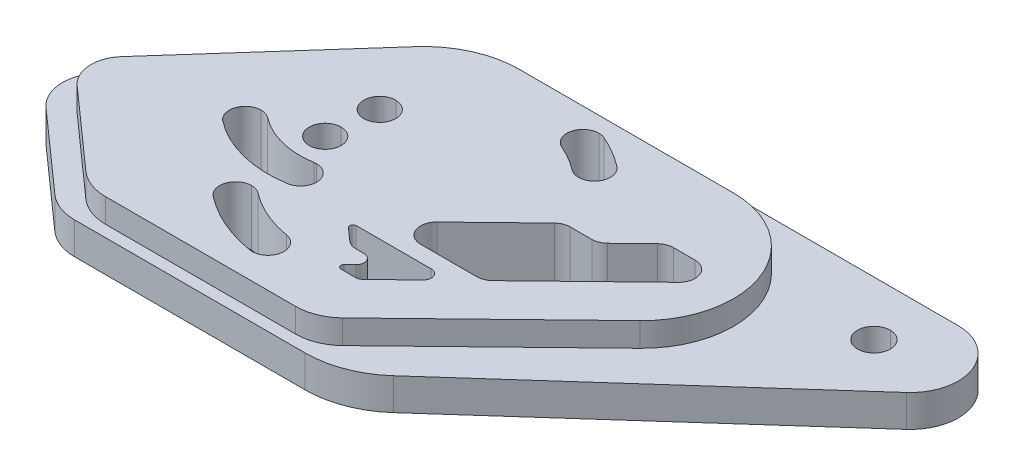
ISO-10303-21;
HEADER;
FILE_DESCRIPTION(('STEP AP214'),'2;1');
FILE_NAME('part.step','',(''),(''),'','','');
FILE_SCHEMA(('AUTOMOTIVE_DESIGN { 1 0 10303 214 1 1 1 1 }'));
ENDSEC;
DATA;
#1=APPLICATION_CONTEXT('core data for automotive mechanical design processes');
#2=APPLICATION_PROTOCOL_DEFINITION('international standard','automotive_design',2000,#1);
#3=PRODUCT_CONTEXT('',#1,'mechanical');
#4=PRODUCT('Part','Part','',(#3));
#5=PRODUCT_RELATED_PRODUCT_CATEGORY('part','',(#4));
#6=PRODUCT_DEFINITION_FORMATION('','',#4);
#7=PRODUCT_DEFINITION_CONTEXT('part definition',#1,'design');
#8=PRODUCT_DEFINITION('design','',#6,#7);
#9=PRODUCT_DEFINITION_SHAPE('','',#8);
#10=(LENGTH_UNIT() NAMED_UNIT(*) SI_UNIT(.MILLI.,.METRE.));
#11=(NAMED_UNIT(*) PLANE_ANGLE_UNIT() SI_UNIT($,.RADIAN.));
#12=(NAMED_UNIT(*) SI_UNIT($,.STERADIAN.) SOLID_ANGLE_UNIT());
#13=UNCERTAINTY_MEASURE_WITH_UNIT(LENGTH_MEASURE(1.E-05),#10,'distance_accuracy_value','');
#14=(GEOMETRIC_REPRESENTATION_CONTEXT(3) GLOBAL_UNCERTAINTY_ASSIGNED_CONTEXT((#13)) GLOBAL_UNIT_ASSIGNED_CONTEXT((#10,
#11,#12)) REPRESENTATION_CONTEXT('',''));
#15=CARTESIAN_POINT('',(0.,0.,0.));
#16=DIRECTION('',(0.,0.,1.));
#17=DIRECTION('',(1.,0.,0.));
#18=AXIS2_PLACEMENT_3D('',#15,#16,#17);
#19=CARTESIAN_POINT('',(-2989.48554446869,3.5,-632.781010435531));
#20=DIRECTION('',(0.,-1.,0.));
#21=DIRECTION('',(0.,0.,-1.));
#22=AXIS2_PLACEMENT_3D('',#19,#20,#21);
#23=CYLINDRICAL_SURFACE('',#22,1.02499999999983);
#24=DIRECTION('',(0.,-1.,0.));
#25=VECTOR('',#24,1.);
#26=CARTESIAN_POINT('',(-2989.48554446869,3.5,-631.756010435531));
#27=LINE('',#26,#25);
#28=CARTESIAN_POINT('',(-2989.48554446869,2.,-631.756010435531));
#29=VERTEX_POINT('',#28);
#30=CARTESIAN_POINT('',(-2989.48554446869,0.,-631.756010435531));
#31=VERTEX_POINT('',#30);
#32=EDGE_CURVE('E1266',#29,#31,#27,.T.);
#33=ORIENTED_EDGE('',*,*,#32,.F.);
#34=CARTESIAN_POINT('',(-2989.48554446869,2.,-632.781010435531));
#35=DIRECTION('',(0.,1.,0.));
#36=DIRECTION('',(0.,0.,1.));
#37=AXIS2_PLACEMENT_3D('',#34,#35,#36);
#38=CIRCLE('',#37,1.02499999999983);
#39=CARTESIAN_POINT('',(-2989.48554446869,2.,-633.806010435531));
#40=VERTEX_POINT('',#39);
#41=EDGE_CURVE('E1022',#29,#40,#38,.T.);
#42=ORIENTED_EDGE('',*,*,#41,.T.);
#43=DIRECTION('',(0.,-1.,0.));
#44=VECTOR('',#43,1.);
#45=CARTESIAN_POINT('',(-2989.48554446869,3.5,-633.806010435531));
#46=LINE('',#45,#44);
#47=CARTESIAN_POINT('',(-2989.48554446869,0.,-633.806010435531));
#48=VERTEX_POINT('',#47);
#49=EDGE_CURVE('E1298',#40,#48,#46,.T.);
#50=ORIENTED_EDGE('',*,*,#49,.T.);
#51=CARTESIAN_POINT('',(-2989.48554446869,0.,-632.781010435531));
#52=DIRECTION('',(0.,-1.,0.));
#53=DIRECTION('',(0.,0.,-1.));
#54=AXIS2_PLACEMENT_3D('',#51,#52,#53);
#55=CIRCLE('',#54,1.02499999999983);
#56=EDGE_CURVE('E822',#48,#31,#55,.T.);
#57=ORIENTED_EDGE('',*,*,#56,.T.);
#58=EDGE_LOOP('',(#33,#42,#50,#57));
#59=FACE_BOUND('',#58,.T.);
#60=ADVANCED_FACE('F16',(#59),#23,.F.);
#61=CARTESIAN_POINT('',(-3000.316982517,2.,-629.106135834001));
#62=DIRECTION('',(0.,1.,0.));
#63=DIRECTION('',(0.,0.,1.));
#64=AXIS2_PLACEMENT_3D('',#61,#62,#63);
#65=CYLINDRICAL_SURFACE('',#64,5.72684267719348);
#66=CARTESIAN_POINT('',(-3000.316982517,3.5,-629.106135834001));
#67=DIRECTION('',(0.,-1.,0.));
#68=DIRECTION('',(0.,0.,1.));
#69=AXIS2_PLACEMENT_3D('',#66,#67,#68);
#70=CIRCLE('',#69,5.72684267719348);
#71=CARTESIAN_POINT('',(-3000.316982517,3.5,-634.832978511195));
#72=VERTEX_POINT('',#71);
#73=CARTESIAN_POINT('',(-2996.33244783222,3.5,-624.992717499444));
#74=VERTEX_POINT('',#73);
#75=EDGE_CURVE('E1113',#72,#74,#70,.T.);
#76=ORIENTED_EDGE('',*,*,#75,.T.);
#77=DIRECTION('',(0.,1.,0.));
#78=VECTOR('',#77,1.);
#79=CARTESIAN_POINT('',(-2996.33244783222,2.,-624.992717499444));
#80=LINE('',#79,#78);
#81=CARTESIAN_POINT('',(-2996.33244783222,2.,-624.992717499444));
#82=VERTEX_POINT('',#81);
#83=EDGE_CURVE('E1294',#82,#74,#80,.T.);
#84=ORIENTED_EDGE('',*,*,#83,.F.);
#85=CARTESIAN_POINT('',(-3000.316982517,2.,-629.106135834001));
#86=DIRECTION('',(0.,-1.,0.));
#87=DIRECTION('',(0.,0.,1.));
#88=AXIS2_PLACEMENT_3D('',#85,#86,#87);
#89=CIRCLE('',#88,5.72684267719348);
#90=CARTESIAN_POINT('',(-3000.316982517,2.,-634.832978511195));
#91=VERTEX_POINT('',#90);
#92=EDGE_CURVE('E997',#91,#82,#89,.T.);
#93=ORIENTED_EDGE('',*,*,#92,.F.);
#94=DIRECTION('',(0.,1.,0.));
#95=VECTOR('',#94,1.);
#96=CARTESIAN_POINT('',(-3000.316982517,2.,-634.832978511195));
#97=LINE('',#96,#95);
#98=EDGE_CURVE('E11',#91,#72,#97,.T.);
#99=ORIENTED_EDGE('',*,*,#98,.T.);
#100=EDGE_LOOP('',(#76,#84,#93,#99));
#101=FACE_BOUND('',#100,.T.);
#102=ADVANCED_FACE('F18',(#101),#65,.T.);
#103=CARTESIAN_POINT('',(-3000.316982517,2.,-634.832978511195));
#104=DIRECTION('',(-1.,0.,0.));
#105=DIRECTION('',(0.,0.,1.));
#106=AXIS2_PLACEMENT_3D('',#103,#104,#105);
#107=PLANE('',#106);
#108=DIRECTION('',(0.,0.,1.));
#109=VECTOR('',#108,1.);
#110=CARTESIAN_POINT('',(-3000.316982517,3.5,-634.832978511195));
#111=LINE('',#110,#109);
#112=CARTESIAN_POINT('',(-3000.316982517,3.5,-634.833427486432));
#113=VERTEX_POINT('',#112);
#114=EDGE_CURVE('E1116',#113,#72,#111,.T.);
#115=ORIENTED_EDGE('',*,*,#114,.T.);
#116=ORIENTED_EDGE('',*,*,#98,.F.);
#117=DIRECTION('',(0.,0.,1.));
#118=VECTOR('',#117,1.);
#119=CARTESIAN_POINT('',(-3000.316982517,2.,-634.832978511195));
#120=LINE('',#119,#118);
#121=CARTESIAN_POINT('',(-3000.316982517,2.,-634.833427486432));
#122=VERTEX_POINT('',#121);
#123=EDGE_CURVE('E1025',#122,#91,#120,.T.);
#124=ORIENTED_EDGE('',*,*,#123,.F.);
#125=DIRECTION('',(0.,-1.,0.));
#126=VECTOR('',#125,1.);
#127=CARTESIAN_POINT('',(-3000.316982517,3.,-634.833427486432));
#128=LINE('',#127,#126);
#129=EDGE_CURVE('E965',#113,#122,#128,.T.);
#130=ORIENTED_EDGE('',*,*,#129,.F.);
#131=EDGE_LOOP('',(#115,#116,#124,#130));
#132=FACE_BOUND('',#131,.T.);
#133=ADVANCED_FACE('F1379',(#132),#107,.F.);
#134=CARTESIAN_POINT('',(-3007.76703592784,3.,-632.861121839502));
#135=DIRECTION('',(0.,-1.,0.));
#136=DIRECTION('',(0.,0.,-1.));
#137=AXIS2_PLACEMENT_3D('',#134,#135,#136);
#138=CYLINDRICAL_SURFACE('',#137,1.);
#139=CARTESIAN_POINT('',(-3007.76703592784,3.5,-632.861121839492));
#140=DIRECTION('',(0.,1.,0.));
#141=DIRECTION('',(0.,0.,1.));
#142=AXIS2_PLACEMENT_3D('',#139,#140,#141);
#143=CIRCLE('',#142,1.00000000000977);
#144=CARTESIAN_POINT('',(-3007.37541870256,3.5,-633.781250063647));
#145=VERTEX_POINT('',#144);
#146=CARTESIAN_POINT('',(-3007.76703592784,3.5,-633.861121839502));
#147=VERTEX_POINT('',#146);
#148=EDGE_CURVE('E1186',#145,#147,#143,.T.);
#149=ORIENTED_EDGE('',*,*,#148,.T.);
#150=DIRECTION('',(0.,-1.,0.));
#151=VECTOR('',#150,1.);
#152=CARTESIAN_POINT('',(-3007.76703592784,3.,-633.861121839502));
#153=LINE('',#152,#151);
#154=CARTESIAN_POINT('',(-3007.76703592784,0.,-633.861121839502));
#155=VERTEX_POINT('',#154);
#156=EDGE_CURVE('E732',#147,#155,#153,.T.);
#157=ORIENTED_EDGE('',*,*,#156,.T.);
#158=CARTESIAN_POINT('',(-3007.76703592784,0.,-632.861121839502));
#159=DIRECTION('',(0.,1.,0.));
#160=DIRECTION('',(0.,0.,1.));
#161=AXIS2_PLACEMENT_3D('',#158,#159,#160);
#162=CIRCLE('',#161,1.);
#163=CARTESIAN_POINT('',(-3007.37541870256,0.,-633.781250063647));
#164=VERTEX_POINT('',#163);
#165=EDGE_CURVE('E901',#164,#155,#162,.T.);
#166=ORIENTED_EDGE('',*,*,#165,.F.);
#167=DIRECTION('',(0.,-1.,0.));
#168=VECTOR('',#167,1.);
#169=CARTESIAN_POINT('',(-3007.37541870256,3.,-633.781250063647));
#170=LINE('',#169,#168);
#171=EDGE_CURVE('E853',#145,#164,#170,.T.);
#172=ORIENTED_EDGE('',*,*,#171,.F.);
#173=EDGE_LOOP('',(#149,#157,#166,#172));
#174=FACE_BOUND('',#173,.T.);
#175=ADVANCED_FACE('F1350',(#174),#138,.F.);
#176=CARTESIAN_POINT('',(-3015.7876022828,3.,-619.166764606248));
#177=DIRECTION('',(0.,-1.,0.));
#178=DIRECTION('',(0.,0.,-1.));
#179=AXIS2_PLACEMENT_3D('',#176,#177,#178);
#180=CYLINDRICAL_SURFACE('',#179,1.);
#181=CARTESIAN_POINT('',(-3015.7876022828,3.5,-619.166764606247));
#182=DIRECTION('',(0.,1.,0.));
#183=DIRECTION('',(0.,0.,1.));
#184=AXIS2_PLACEMENT_3D('',#181,#182,#183);
#185=CIRCLE('',#184,1.);
#186=CARTESIAN_POINT('',(-3015.17664871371,3.5,-619.95843103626));
#187=VERTEX_POINT('',#186);
#188=CARTESIAN_POINT('',(-3015.7876022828,3.5,-620.166764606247));
#189=VERTEX_POINT('',#188);
#190=EDGE_CURVE('E1219',#187,#189,#185,.T.);
#191=ORIENTED_EDGE('',*,*,#190,.T.);
#192=DIRECTION('',(0.,-1.,0.));
#193=VECTOR('',#192,1.);
#194=CARTESIAN_POINT('',(-3015.7876022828,3.,-620.166764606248));
#195=LINE('',#194,#193);
#196=CARTESIAN_POINT('',(-3015.7876022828,0.,-620.166764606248));
#197=VERTEX_POINT('',#196);
#198=EDGE_CURVE('E721',#189,#197,#195,.T.);
#199=ORIENTED_EDGE('',*,*,#198,.T.);
#200=CARTESIAN_POINT('',(-3015.7876022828,0.,-619.166764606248));
#201=DIRECTION('',(0.,1.,0.));
#202=DIRECTION('',(0.,0.,1.));
#203=AXIS2_PLACEMENT_3D('',#200,#201,#202);
#204=CIRCLE('',#203,1.);
#205=CARTESIAN_POINT('',(-3015.17664871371,0.,-619.95843103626));
#206=VERTEX_POINT('',#205);
#207=EDGE_CURVE('E878',#206,#197,#204,.T.);
#208=ORIENTED_EDGE('',*,*,#207,.F.);
#209=DIRECTION('',(0.,-1.,0.));
#210=VECTOR('',#209,1.);
#211=CARTESIAN_POINT('',(-3015.17664871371,3.,-619.95843103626));
#212=LINE('',#211,#210);
#213=EDGE_CURVE('E630',#187,#206,#212,.T.);
#214=ORIENTED_EDGE('',*,*,#213,.F.);
#215=EDGE_LOOP('',(#191,#199,#208,#214));
#216=FACE_BOUND('',#215,.T.);
#217=ADVANCED_FACE('F1512',(#216),#180,.F.);
#218=CARTESIAN_POINT('',(-3014.9385816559,3.,-622.379856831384));
#219=DIRECTION('',(0.,-1.,0.));
#220=DIRECTION('',(0.,0.,-1.));
#221=AXIS2_PLACEMENT_3D('',#218,#219,#220);
#222=CYLINDRICAL_SURFACE('',#221,1.00000000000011);
#223=CARTESIAN_POINT('',(-3014.9385816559,3.5,-622.379856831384));
#224=DIRECTION('',(0.,1.,0.));
#225=DIRECTION('',(0.,0.,-1.));
#226=AXIS2_PLACEMENT_3D('',#223,#224,#225);
#227=CIRCLE('',#226,1.00000000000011);
#228=CARTESIAN_POINT('',(-3014.77702041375,3.5,-621.39299414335));
#229=VERTEX_POINT('',#228);
#230=CARTESIAN_POINT('',(-3014.9385816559,3.5,-623.379856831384));
#231=VERTEX_POINT('',#230);
#232=EDGE_CURVE('E689',#229,#231,#227,.T.);
#233=ORIENTED_EDGE('',*,*,#232,.T.);
#234=DIRECTION('',(0.,-1.,0.));
#235=VECTOR('',#234,1.);
#236=CARTESIAN_POINT('',(-3014.9385816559,3.,-623.379856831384));
#237=LINE('',#236,#235);
#238=CARTESIAN_POINT('',(-3014.9385816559,0.,-623.379856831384));
#239=VERTEX_POINT('',#238);
#240=EDGE_CURVE('E756',#231,#239,#237,.T.);
#241=ORIENTED_EDGE('',*,*,#240,.T.);
#242=CARTESIAN_POINT('',(-3014.9385816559,0.,-622.379856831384));
#243=DIRECTION('',(0.,1.,0.));
#244=DIRECTION('',(0.,0.,-1.));
#245=AXIS2_PLACEMENT_3D('',#242,#243,#244);
#246=CIRCLE('',#245,1.00000000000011);
#247=CARTESIAN_POINT('',(-3014.77702041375,0.,-621.39299414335));
#248=VERTEX_POINT('',#247);
#249=EDGE_CURVE('E681',#248,#239,#246,.T.);
#250=ORIENTED_EDGE('',*,*,#249,.F.);
#251=DIRECTION('',(0.,-1.,0.));
#252=VECTOR('',#251,1.);
#253=CARTESIAN_POINT('',(-3014.77702041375,3.,-621.39299414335));
#254=LINE('',#253,#252);
#255=EDGE_CURVE('E654',#229,#248,#254,.T.);
#256=ORIENTED_EDGE('',*,*,#255,.F.);
#257=EDGE_LOOP('',(#233,#241,#250,#256));
#258=FACE_BOUND('',#257,.T.);
#259=ADVANCED_FACE('F1508',(#258),#222,.F.);
#260=CARTESIAN_POINT('',(-3019.57367052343,3.,-623.551034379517));
#261=DIRECTION('',(0.,-1.,0.));
#262=DIRECTION('',(0.,0.,-1.));
#263=AXIS2_PLACEMENT_3D('',#260,#261,#262);
#264=CYLINDRICAL_SURFACE('',#263,1.);
#265=CARTESIAN_POINT('',(-3019.57367052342,3.5,-623.551034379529));
#266=DIRECTION('',(0.,1.,0.));
#267=DIRECTION('',(0.,0.,1.));
#268=AXIS2_PLACEMENT_3D('',#265,#266,#267);
#269=CIRCLE('',#268,0.999999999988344);
#270=CARTESIAN_POINT('',(-3018.96271695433,3.5,-624.342700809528));
#271=VERTEX_POINT('',#270);
#272=CARTESIAN_POINT('',(-3019.57367052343,3.5,-624.551034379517));
#273=VERTEX_POINT('',#272);
#274=EDGE_CURVE('E668',#271,#273,#269,.T.);
#275=ORIENTED_EDGE('',*,*,#274,.T.);
#276=DIRECTION('',(0.,-1.,0.));
#277=VECTOR('',#276,1.);
#278=CARTESIAN_POINT('',(-3019.57367052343,3.,-624.551034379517));
#279=LINE('',#278,#277);
#280=CARTESIAN_POINT('',(-3019.57367052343,0.,-624.551034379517));
#281=VERTEX_POINT('',#280);
#282=EDGE_CURVE('E769',#273,#281,#279,.T.);
#283=ORIENTED_EDGE('',*,*,#282,.T.);
#284=CARTESIAN_POINT('',(-3019.57367052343,0.,-623.551034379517));
#285=DIRECTION('',(0.,1.,0.));
#286=DIRECTION('',(0.,0.,1.));
#287=AXIS2_PLACEMENT_3D('',#284,#285,#286);
#288=CIRCLE('',#287,1.);
#289=CARTESIAN_POINT('',(-3018.96271695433,0.,-624.342700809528));
#290=VERTEX_POINT('',#289);
#291=EDGE_CURVE('E713',#290,#281,#288,.T.);
#292=ORIENTED_EDGE('',*,*,#291,.F.);
#293=DIRECTION('',(0.,-1.,0.));
#294=VECTOR('',#293,1.);
#295=CARTESIAN_POINT('',(-3018.96271695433,3.,-624.342700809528));
#296=LINE('',#295,#294);
#297=EDGE_CURVE('E657',#271,#290,#296,.T.);
#298=ORIENTED_EDGE('',*,*,#297,.F.);
#299=EDGE_LOOP('',(#275,#283,#292,#298));
#300=FACE_BOUND('',#299,.T.);
#301=ADVANCED_FACE('F1511',(#300),#264,.F.);
#302=CARTESIAN_POINT('',(-3016.15747695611,3.,-625.136420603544));
#303=DIRECTION('',(0.,-1.,0.));
#304=DIRECTION('',(0.,0.,-1.));
#305=AXIS2_PLACEMENT_3D('',#302,#303,#304);
#306=CYLINDRICAL_SURFACE('',#305,1.);
#307=CARTESIAN_POINT('',(-3016.15747695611,3.5,-625.136420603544));
#308=DIRECTION('',(0.,1.,0.));
#309=DIRECTION('',(0.,0.,1.));
#310=AXIS2_PLACEMENT_3D('',#307,#308,#309);
#311=CIRCLE('',#310,1.);
#312=CARTESIAN_POINT('',(-3016.15747695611,3.5,-626.136420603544));
#313=VERTEX_POINT('',#312);
#314=CARTESIAN_POINT('',(-3016.15747695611,3.5,-624.136420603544));
#315=VERTEX_POINT('',#314);
#316=EDGE_CURVE('E1157',#313,#315,#311,.T.);
#317=ORIENTED_EDGE('',*,*,#316,.T.);
#318=DIRECTION('',(0.,-1.,0.));
#319=VECTOR('',#318,1.);
#320=CARTESIAN_POINT('',(-3016.15747695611,3.,-624.136420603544));
#321=LINE('',#320,#319);
#322=CARTESIAN_POINT('',(-3016.15747695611,0.,-624.136420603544));
#323=VERTEX_POINT('',#322);
#324=EDGE_CURVE('E727',#315,#323,#321,.T.);
#325=ORIENTED_EDGE('',*,*,#324,.T.);
#326=CARTESIAN_POINT('',(-3016.15747695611,0.,-625.136420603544));
#327=DIRECTION('',(0.,1.,0.));
#328=DIRECTION('',(0.,0.,1.));
#329=AXIS2_PLACEMENT_3D('',#326,#327,#328);
#330=CIRCLE('',#329,1.);
#331=CARTESIAN_POINT('',(-3016.15747695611,0.,-626.136420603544));
#332=VERTEX_POINT('',#331);
#333=EDGE_CURVE('E889',#332,#323,#330,.T.);
#334=ORIENTED_EDGE('',*,*,#333,.F.);
#335=DIRECTION('',(0.,-1.,0.));
#336=VECTOR('',#335,1.);
#337=CARTESIAN_POINT('',(-3016.15747695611,3.,-626.136420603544));
#338=LINE('',#337,#336);
#339=EDGE_CURVE('E779',#313,#332,#338,.T.);
#340=ORIENTED_EDGE('',*,*,#339,.F.);
#341=EDGE_LOOP('',(#317,#325,#334,#340));
#342=FACE_BOUND('',#341,.T.);
#343=ADVANCED_FACE('F1506',(#342),#306,.F.);
#344=CARTESIAN_POINT('',(-3015.90794910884,3.,-628.301032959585));
#345=DIRECTION('',(0.,-1.,0.));
#346=DIRECTION('',(0.,0.,-1.));
#347=AXIS2_PLACEMENT_3D('',#344,#345,#346);
#348=CYLINDRICAL_SURFACE('',#347,1.);
#349=CARTESIAN_POINT('',(-3015.90794910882,3.5,-628.301032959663));
#350=DIRECTION('',(0.,1.,0.));
#351=DIRECTION('',(0.,0.,1.));
#352=AXIS2_PLACEMENT_3D('',#349,#350,#351);
#353=CIRCLE('',#352,1.00000000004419);
#354=CARTESIAN_POINT('',(-3015.90794910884,3.5,-629.301032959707));
#355=VERTEX_POINT('',#354);
#356=CARTESIAN_POINT('',(-3015.90794910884,3.5,-627.301032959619));
#357=VERTEX_POINT('',#356);
#358=EDGE_CURVE('E1169',#355,#357,#353,.T.);
#359=ORIENTED_EDGE('',*,*,#358,.T.);
#360=DIRECTION('',(0.,-1.,0.));
#361=VECTOR('',#360,1.);
#362=CARTESIAN_POINT('',(-3015.90794910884,3.,-627.301032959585));
#363=LINE('',#362,#361);
#364=CARTESIAN_POINT('',(-3015.90794910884,0.,-627.301032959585));
#365=VERTEX_POINT('',#364);
#366=EDGE_CURVE('E793',#357,#365,#363,.T.);
#367=ORIENTED_EDGE('',*,*,#366,.T.);
#368=CARTESIAN_POINT('',(-3015.90794910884,0.,-628.301032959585));
#369=DIRECTION('',(0.,1.,0.));
#370=DIRECTION('',(0.,0.,1.));
#371=AXIS2_PLACEMENT_3D('',#368,#369,#370);
#372=CIRCLE('',#371,1.);
#373=CARTESIAN_POINT('',(-3015.90794910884,0.,-629.301032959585));
#374=VERTEX_POINT('',#373);
#375=EDGE_CURVE('E892',#374,#365,#372,.T.);
#376=ORIENTED_EDGE('',*,*,#375,.F.);
#377=DIRECTION('',(0.,-1.,0.));
#378=VECTOR('',#377,1.);
#379=CARTESIAN_POINT('',(-3015.90794910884,3.,-629.301032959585));
#380=LINE('',#379,#378);
#381=EDGE_CURVE('E1168',#355,#374,#380,.T.);
#382=ORIENTED_EDGE('',*,*,#381,.F.);
#383=EDGE_LOOP('',(#359,#367,#376,#382));
#384=FACE_BOUND('',#383,.T.);
#385=ADVANCED_FACE('F1502',(#384),#348,.F.);
#386=CARTESIAN_POINT('',(-3007.32428702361,-9.,-623.270727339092));
#387=DIRECTION('',(0.,-1.,0.));
#388=DIRECTION('',(0.,0.,-1.));
#389=AXIS2_PLACEMENT_3D('',#386,#387,#388);
#390=CYLINDRICAL_SURFACE('',#389,1.);
#391=CARTESIAN_POINT('',(-3007.32428702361,0.,-623.270727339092));
#392=DIRECTION('',(0.,1.,0.));
#393=DIRECTION('',(0.,0.,1.));
#394=AXIS2_PLACEMENT_3D('',#391,#392,#393);
#395=CIRCLE('',#394,1.);
#396=CARTESIAN_POINT('',(-3008.02005167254,0.,-623.9889971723));
#397=VERTEX_POINT('',#396);
#398=CARTESIAN_POINT('',(-3007.32428702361,0.,-622.270727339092));
#399=VERTEX_POINT('',#398);
#400=EDGE_CURVE('E624',#397,#399,#395,.T.);
#401=ORIENTED_EDGE('',*,*,#400,.F.);
#402=DIRECTION('',(0.,-1.,0.));
#403=VECTOR('',#402,1.);
#404=CARTESIAN_POINT('',(-3008.02005167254,0.,-623.9889971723));
#405=LINE('',#404,#403);
#406=CARTESIAN_POINT('',(-3008.02005167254,3.5,-623.9889971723));
#407=VERTEX_POINT('',#406);
#408=EDGE_CURVE('E26',#407,#397,#405,.T.);
#409=ORIENTED_EDGE('',*,*,#408,.F.);
#410=CARTESIAN_POINT('',(-3007.32428702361,3.5,-623.270727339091));
#411=DIRECTION('',(0.,1.,0.));
#412=DIRECTION('',(0.,0.,1.));
#413=AXIS2_PLACEMENT_3D('',#410,#411,#412);
#414=CIRCLE('',#413,0.999999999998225);
#415=CARTESIAN_POINT('',(-3007.32428702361,3.5,-622.270727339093));
#416=VERTEX_POINT('',#415);
#417=EDGE_CURVE('E1226',#407,#416,#414,.T.);
#418=ORIENTED_EDGE('',*,*,#417,.T.);
#419=DIRECTION('',(0.,1.,0.));
#420=VECTOR('',#419,1.);
#421=CARTESIAN_POINT('',(-3007.32428702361,3.,-622.270727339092));
#422=LINE('',#421,#420);
#423=EDGE_CURVE('E1090',#399,#416,#422,.T.);
#424=ORIENTED_EDGE('',*,*,#423,.F.);
#425=EDGE_LOOP('',(#401,#409,#418,#424));
#426=FACE_BOUND('',#425,.T.);
#427=ADVANCED_FACE('F1499',(#426),#390,.F.);
#428=CARTESIAN_POINT('',(-3003.80095394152,-9.,-623.270727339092));
#429=DIRECTION('',(0.,-1.,0.));
#430=DIRECTION('',(0.,0.,-1.));
#431=AXIS2_PLACEMENT_3D('',#428,#429,#430);
#432=CYLINDRICAL_SURFACE('',#431,1.);
#433=CARTESIAN_POINT('',(-3003.80095394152,0.,-623.270727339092));
#434=DIRECTION('',(0.,1.,0.));
#435=DIRECTION('',(0.,0.,1.));
#436=AXIS2_PLACEMENT_3D('',#433,#434,#435);
#437=CIRCLE('',#436,1.);
#438=CARTESIAN_POINT('',(-3003.80095394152,0.,-622.270727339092));
#439=VERTEX_POINT('',#438);
#440=CARTESIAN_POINT('',(-3003.10518929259,0.,-622.552457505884));
#441=VERTEX_POINT('',#440);
#442=EDGE_CURVE('E764',#439,#441,#437,.T.);
#443=ORIENTED_EDGE('',*,*,#442,.F.);
#444=DIRECTION('',(0.,-1.,0.));
#445=VECTOR('',#444,1.);
#446=CARTESIAN_POINT('',(-3003.80095394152,0.,-622.270727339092));
#447=LINE('',#446,#445);
#448=CARTESIAN_POINT('',(-3003.80095394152,3.5,-622.270727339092));
#449=VERTEX_POINT('',#448);
#450=EDGE_CURVE('E598',#449,#439,#447,.T.);
#451=ORIENTED_EDGE('',*,*,#450,.F.);
#452=CARTESIAN_POINT('',(-3003.80095394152,3.5,-623.270727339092));
#453=DIRECTION('',(0.,1.,0.));
#454=DIRECTION('',(0.,0.,1.));
#455=AXIS2_PLACEMENT_3D('',#452,#453,#454);
#456=CIRCLE('',#455,1.00000000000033);
#457=CARTESIAN_POINT('',(-3003.10518929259,3.5,-622.552457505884));
#458=VERTEX_POINT('',#457);
#459=EDGE_CURVE('E596',#449,#458,#456,.T.);
#460=ORIENTED_EDGE('',*,*,#459,.T.);
#461=DIRECTION('',(0.,1.,0.));
#462=VECTOR('',#461,1.);
#463=CARTESIAN_POINT('',(-3003.10518929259,3.,-622.552457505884));
#464=LINE('',#463,#462);
#465=EDGE_CURVE('E580',#441,#458,#464,.T.);
#466=ORIENTED_EDGE('',*,*,#465,.F.);
#467=EDGE_LOOP('',(#443,#451,#460,#466));
#468=FACE_BOUND('',#467,.T.);
#469=ADVANCED_FACE('F597',(#468),#432,.F.);
#470=CARTESIAN_POINT('',(-3003.58769037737,-9.,-626.890247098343));
#471=DIRECTION('',(0.,-1.,0.));
#472=DIRECTION('',(0.,0.,-1.));
#473=AXIS2_PLACEMENT_3D('',#470,#471,#472);
#474=CYLINDRICAL_SURFACE('',#473,1.);
#475=CARTESIAN_POINT('',(-3003.58769037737,0.,-626.890247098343));
#476=DIRECTION('',(0.,1.,0.));
#477=DIRECTION('',(0.,0.,1.));
#478=AXIS2_PLACEMENT_3D('',#475,#476,#477);
#479=CIRCLE('',#478,1.);
#480=CARTESIAN_POINT('',(-3003.58769037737,0.,-627.890247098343));
#481=VERTEX_POINT('',#480);
#482=CARTESIAN_POINT('',(-3004.2834550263,0.,-627.608516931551));
#483=VERTEX_POINT('',#482);
#484=EDGE_CURVE('E827',#481,#483,#479,.T.);
#485=ORIENTED_EDGE('',*,*,#484,.F.);
#486=DIRECTION('',(0.,-1.,0.));
#487=VECTOR('',#486,1.);
#488=CARTESIAN_POINT('',(-3003.58769037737,0.,-627.890247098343));
#489=LINE('',#488,#487);
#490=CARTESIAN_POINT('',(-3003.58769037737,3.5,-627.890247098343));
#491=VERTEX_POINT('',#490);
#492=EDGE_CURVE('E927',#491,#481,#489,.T.);
#493=ORIENTED_EDGE('',*,*,#492,.F.);
#494=CARTESIAN_POINT('',(-3003.58769037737,3.5,-626.890247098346));
#495=DIRECTION('',(0.,1.,0.));
#496=DIRECTION('',(0.,0.,-1.));
#497=AXIS2_PLACEMENT_3D('',#494,#495,#496);
#498=CIRCLE('',#497,0.999999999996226);
#499=CARTESIAN_POINT('',(-3004.2834550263,3.5,-627.608516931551));
#500=VERTEX_POINT('',#499);
#501=EDGE_CURVE('E1125',#491,#500,#498,.T.);
#502=ORIENTED_EDGE('',*,*,#501,.T.);
#503=DIRECTION('',(0.,1.,0.));
#504=VECTOR('',#503,1.);
#505=CARTESIAN_POINT('',(-3004.2834550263,3.,-627.608516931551));
#506=LINE('',#505,#504);
#507=EDGE_CURVE('E20',#483,#500,#506,.T.);
#508=ORIENTED_EDGE('',*,*,#507,.F.);
#509=EDGE_LOOP('',(#485,#493,#502,#508));
#510=FACE_BOUND('',#509,.T.);
#511=ADVANCED_FACE('F1493',(#510),#474,.F.);
#512=CARTESIAN_POINT('',(-3002.23243608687,-9.,-628.890247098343));
#513=DIRECTION('',(0.,1.,0.));
#514=DIRECTION('',(0.,0.,1.));
#515=AXIS2_PLACEMENT_3D('',#512,#513,#514);
#516=CYLINDRICAL_SURFACE('',#515,1.);
#517=CARTESIAN_POINT('',(-3002.23243608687,0.,-628.890247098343));
#518=DIRECTION('',(0.,-1.,0.));
#519=DIRECTION('',(0.,0.,1.));
#520=AXIS2_PLACEMENT_3D('',#517,#518,#519);
#521=CIRCLE('',#520,1.);
#522=CARTESIAN_POINT('',(-3001.53667143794,0.,-628.171977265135));
#523=VERTEX_POINT('',#522);
#524=CARTESIAN_POINT('',(-3002.23243608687,0.,-627.890247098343));
#525=VERTEX_POINT('',#524);
#526=EDGE_CURVE('E821',#523,#525,#521,.T.);
#527=ORIENTED_EDGE('',*,*,#526,.F.);
#528=DIRECTION('',(0.,-1.,0.));
#529=VECTOR('',#528,1.);
#530=CARTESIAN_POINT('',(-3001.53667143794,-9.,-628.171977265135));
#531=LINE('',#530,#529);
#532=CARTESIAN_POINT('',(-3001.53667143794,3.5,-628.171977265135));
#533=VERTEX_POINT('',#532);
#534=EDGE_CURVE('E1080',#533,#523,#531,.T.);
#535=ORIENTED_EDGE('',*,*,#534,.F.);
#536=CARTESIAN_POINT('',(-3002.23243608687,3.5,-628.890247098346));
#537=DIRECTION('',(0.,-1.,0.));
#538=DIRECTION('',(0.,0.,1.));
#539=AXIS2_PLACEMENT_3D('',#536,#537,#538);
#540=CIRCLE('',#539,1.00000000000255);
#541=CARTESIAN_POINT('',(-3002.23243608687,3.5,-627.890247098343));
#542=VERTEX_POINT('',#541);
#543=EDGE_CURVE('E1124',#533,#542,#540,.T.);
#544=ORIENTED_EDGE('',*,*,#543,.T.);
#545=DIRECTION('',(0.,1.,0.));
#546=VECTOR('',#545,1.);
#547=CARTESIAN_POINT('',(-3002.23243608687,-9.,-627.890247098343));
#548=LINE('',#547,#546);
#549=EDGE_CURVE('E931',#525,#542,#548,.T.);
#550=ORIENTED_EDGE('',*,*,#549,.F.);
#551=EDGE_LOOP('',(#527,#535,#544,#550));
#552=FACE_BOUND('',#551,.T.);
#553=ADVANCED_FACE('F1489',(#552),#516,.T.);
#554=CARTESIAN_POINT('',(-2999.24589785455,-9.,-628.998740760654));
#555=DIRECTION('',(0.,-1.,0.));
#556=DIRECTION('',(0.,0.,-1.));
#557=AXIS2_PLACEMENT_3D('',#554,#555,#556);
#558=CYLINDRICAL_SURFACE('',#557,1.);
#559=CARTESIAN_POINT('',(-2999.24589785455,0.,-628.998740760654));
#560=DIRECTION('',(0.,1.,0.));
#561=DIRECTION('',(0.,0.,1.));
#562=AXIS2_PLACEMENT_3D('',#559,#560,#561);
#563=CIRCLE('',#562,1.);
#564=CARTESIAN_POINT('',(-2999.24589785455,0.,-629.998740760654));
#565=VERTEX_POINT('',#564);
#566=CARTESIAN_POINT('',(-2999.94166250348,0.,-629.717010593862));
#567=VERTEX_POINT('',#566);
#568=EDGE_CURVE('E648',#565,#567,#563,.T.);
#569=ORIENTED_EDGE('',*,*,#568,.F.);
#570=DIRECTION('',(0.,-1.,0.));
#571=VECTOR('',#570,1.);
#572=CARTESIAN_POINT('',(-2999.24589785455,0.,-629.998740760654));
#573=LINE('',#572,#571);
#574=CARTESIAN_POINT('',(-2999.24589785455,3.5,-629.998740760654));
#575=VERTEX_POINT('',#574);
#576=EDGE_CURVE('E593',#575,#565,#573,.T.);
#577=ORIENTED_EDGE('',*,*,#576,.F.);
#578=CARTESIAN_POINT('',(-2999.24589785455,3.5,-628.99874076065));
#579=DIRECTION('',(0.,1.,0.));
#580=DIRECTION('',(0.,0.,-1.));
#581=AXIS2_PLACEMENT_3D('',#578,#579,#580);
#582=CIRCLE('',#581,1.00000000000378);
#583=CARTESIAN_POINT('',(-2999.94166250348,3.5,-629.717010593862));
#584=VERTEX_POINT('',#583);
#585=EDGE_CURVE('E1240',#575,#584,#582,.T.);
#586=ORIENTED_EDGE('',*,*,#585,.T.);
#587=DIRECTION('',(0.,1.,0.));
#588=VECTOR('',#587,1.);
#589=CARTESIAN_POINT('',(-2999.94166250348,3.,-629.717010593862));
#590=LINE('',#589,#588);
#591=EDGE_CURVE('E930',#567,#584,#590,.T.);
#592=ORIENTED_EDGE('',*,*,#591,.F.);
#593=EDGE_LOOP('',(#569,#577,#586,#592));
#594=FACE_BOUND('',#593,.T.);
#595=ADVANCED_FACE('F1485',(#594),#558,.F.);
#596=CARTESIAN_POINT('',(-2997.88766235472,-9.,-628.998740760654));
#597=DIRECTION('',(0.,-1.,0.));
#598=DIRECTION('',(0.,0.,-1.));
#599=AXIS2_PLACEMENT_3D('',#596,#597,#598);
#600=CYLINDRICAL_SURFACE('',#599,1.);
#601=CARTESIAN_POINT('',(-2997.88766235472,0.,-628.998740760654));
#602=DIRECTION('',(0.,1.,0.));
#603=DIRECTION('',(0.,0.,1.));
#604=AXIS2_PLACEMENT_3D('',#601,#602,#603);
#605=CIRCLE('',#604,1.);
#606=CARTESIAN_POINT('',(-2997.19189770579,0.,-628.280470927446));
#607=VERTEX_POINT('',#606);
#608=CARTESIAN_POINT('',(-2997.88766235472,0.,-629.998740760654));
#609=VERTEX_POINT('',#608);
#610=EDGE_CURVE('E763',#607,#609,#605,.T.);
#611=ORIENTED_EDGE('',*,*,#610,.F.);
#612=DIRECTION('',(0.,-1.,0.));
#613=VECTOR('',#612,1.);
#614=CARTESIAN_POINT('',(-2997.19189770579,0.,-628.280470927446));
#615=LINE('',#614,#613);
#616=CARTESIAN_POINT('',(-2997.19189770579,3.5,-628.280470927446));
#617=VERTEX_POINT('',#616);
#618=EDGE_CURVE('E592',#617,#607,#615,.T.);
#619=ORIENTED_EDGE('',*,*,#618,.F.);
#620=CARTESIAN_POINT('',(-2997.88766235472,3.5,-628.998740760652));
#621=DIRECTION('',(0.,1.,0.));
#622=DIRECTION('',(0.,0.,-1.));
#623=AXIS2_PLACEMENT_3D('',#620,#621,#622);
#624=CIRCLE('',#623,1.00000000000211);
#625=CARTESIAN_POINT('',(-2997.88766235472,3.5,-629.998740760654));
#626=VERTEX_POINT('',#625);
#627=EDGE_CURVE('E610',#617,#626,#624,.T.);
#628=ORIENTED_EDGE('',*,*,#627,.T.);
#629=DIRECTION('',(0.,1.,0.));
#630=VECTOR('',#629,1.);
#631=CARTESIAN_POINT('',(-2997.88766235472,3.,-629.998740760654));
#632=LINE('',#631,#630);
#633=EDGE_CURVE('E1083',#609,#626,#632,.T.);
#634=ORIENTED_EDGE('',*,*,#633,.F.);
#635=EDGE_LOOP('',(#611,#619,#628,#634));
#636=FACE_BOUND('',#635,.T.);
#637=ADVANCED_FACE('F1481',(#636),#600,.F.);
#638=CARTESIAN_POINT('',(-3007.55743711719,-9.,-618.935826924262));
#639=DIRECTION('',(0.,-1.,0.));
#640=DIRECTION('',(0.,0.,-1.));
#641=AXIS2_PLACEMENT_3D('',#638,#639,#640);
#642=CYLINDRICAL_SURFACE('',#641,0.499999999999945);
#643=CARTESIAN_POINT('',(-3007.55743711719,0.,-618.935826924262));
#644=DIRECTION('',(0.,1.,0.));
#645=DIRECTION('',(0.,0.,1.));
#646=AXIS2_PLACEMENT_3D('',#643,#644,#645);
#647=CIRCLE('',#646,0.499999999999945);
#648=CARTESIAN_POINT('',(-3007.55743711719,0.,-618.435826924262));
#649=VERTEX_POINT('',#648);
#650=CARTESIAN_POINT('',(-3007.20955479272,0.,-618.576692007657));
#651=VERTEX_POINT('',#650);
#652=EDGE_CURVE('E839',#649,#651,#647,.T.);
#653=ORIENTED_EDGE('',*,*,#652,.F.);
#654=DIRECTION('',(0.,-1.,0.));
#655=VECTOR('',#654,1.);
#656=CARTESIAN_POINT('',(-3007.55743711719,0.,-618.435826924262));
#657=LINE('',#656,#655);
#658=CARTESIAN_POINT('',(-3007.55743711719,3.5,-618.435826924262));
#659=VERTEX_POINT('',#658);
#660=EDGE_CURVE('E1061',#659,#649,#657,.T.);
#661=ORIENTED_EDGE('',*,*,#660,.F.);
#662=CARTESIAN_POINT('',(-3007.55743711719,3.5,-618.935826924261));
#663=DIRECTION('',(0.,1.,0.));
#664=DIRECTION('',(0.,0.,1.));
#665=AXIS2_PLACEMENT_3D('',#662,#663,#664);
#666=CIRCLE('',#665,0.499999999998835);
#667=CARTESIAN_POINT('',(-3007.20955479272,3.5,-618.576692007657));
#668=VERTEX_POINT('',#667);
#669=EDGE_CURVE('E639',#659,#668,#666,.T.);
#670=ORIENTED_EDGE('',*,*,#669,.T.);
#671=DIRECTION('',(0.,1.,0.));
#672=VECTOR('',#671,1.);
#673=CARTESIAN_POINT('',(-3007.20955479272,3.,-618.576692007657));
#674=LINE('',#673,#672);
#675=EDGE_CURVE('E698',#651,#668,#674,.T.);
#676=ORIENTED_EDGE('',*,*,#675,.F.);
#677=EDGE_LOOP('',(#653,#661,#670,#676));
#678=FACE_BOUND('',#677,.T.);
#679=ADVANCED_FACE('F1477',(#678),#642,.F.);
#680=CARTESIAN_POINT('',(-3010.35715904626,-9.,-621.070727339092));
#681=DIRECTION('',(0.,-1.,0.));
#682=DIRECTION('',(0.,0.,-1.));
#683=AXIS2_PLACEMENT_3D('',#680,#681,#682);
#684=CYLINDRICAL_SURFACE('',#683,0.199999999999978);
#685=CARTESIAN_POINT('',(-3010.35715904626,0.,-621.070727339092));
#686=DIRECTION('',(0.,1.,0.));
#687=DIRECTION('',(0.,0.,1.));
#688=AXIS2_PLACEMENT_3D('',#685,#686,#687);
#689=CIRCLE('',#688,0.199999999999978);
#690=CARTESIAN_POINT('',(-3010.35715904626,0.,-621.270727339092));
#691=VERTEX_POINT('',#690);
#692=CARTESIAN_POINT('',(-3010.49003997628,0.,-620.921252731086));
#693=VERTEX_POINT('',#692);
#694=EDGE_CURVE('E870',#691,#693,#689,.T.);
#695=ORIENTED_EDGE('',*,*,#694,.F.);
#696=DIRECTION('',(0.,-1.,0.));
#697=VECTOR('',#696,1.);
#698=CARTESIAN_POINT('',(-3010.35715904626,0.,-621.270727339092));
#699=LINE('',#698,#697);
#700=CARTESIAN_POINT('',(-3010.35715904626,3.5,-621.270727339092));
#701=VERTEX_POINT('',#700);
#702=EDGE_CURVE('E695',#701,#691,#699,.T.);
#703=ORIENTED_EDGE('',*,*,#702,.F.);
#704=CARTESIAN_POINT('',(-3010.35715904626,3.5,-621.070727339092));
#705=DIRECTION('',(0.,1.,0.));
#706=DIRECTION('',(0.,0.,-1.));
#707=AXIS2_PLACEMENT_3D('',#704,#705,#706);
#708=CIRCLE('',#707,0.199999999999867);
#709=CARTESIAN_POINT('',(-3010.49003997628,3.5,-620.921252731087));
#710=VERTEX_POINT('',#709);
#711=EDGE_CURVE('E680',#701,#710,#708,.T.);
#712=ORIENTED_EDGE('',*,*,#711,.T.);
#713=DIRECTION('',(0.,1.,0.));
#714=VECTOR('',#713,1.);
#715=CARTESIAN_POINT('',(-3010.49003997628,3.,-620.921252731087));
#716=LINE('',#715,#714);
#717=EDGE_CURVE('E1073',#693,#710,#716,.T.);
#718=ORIENTED_EDGE('',*,*,#717,.F.);
#719=EDGE_LOOP('',(#695,#703,#712,#718));
#720=FACE_BOUND('',#719,.T.);
#721=ADVANCED_FACE('F1473',(#720),#684,.F.);
#722=CARTESIAN_POINT('',(-3008.47641454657,-9.,-618.635826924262));
#723=DIRECTION('',(0.,-1.,0.));
#724=DIRECTION('',(0.,0.,-1.));
#725=AXIS2_PLACEMENT_3D('',#722,#723,#724);
#726=CYLINDRICAL_SURFACE('',#725,0.199999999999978);
#727=CARTESIAN_POINT('',(-3008.47641454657,0.,-618.635826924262));
#728=DIRECTION('',(0.,1.,0.));
#729=DIRECTION('',(0.,0.,1.));
#730=AXIS2_PLACEMENT_3D('',#727,#728,#729);
#731=CIRCLE('',#730,0.199999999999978);
#732=CARTESIAN_POINT('',(-3008.61556747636,0.,-618.779480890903));
#733=VERTEX_POINT('',#732);
#734=CARTESIAN_POINT('',(-3008.47641454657,0.,-618.435826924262));
#735=VERTEX_POINT('',#734);
#736=EDGE_CURVE('E751',#733,#735,#731,.T.);
#737=ORIENTED_EDGE('',*,*,#736,.F.);
#738=DIRECTION('',(0.,-1.,0.));
#739=VECTOR('',#738,1.);
#740=CARTESIAN_POINT('',(-3008.61556747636,0.,-618.779480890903));
#741=LINE('',#740,#739);
#742=CARTESIAN_POINT('',(-3008.61556747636,3.5,-618.779480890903));
#743=VERTEX_POINT('',#742);
#744=EDGE_CURVE('E1067',#743,#733,#741,.T.);
#745=ORIENTED_EDGE('',*,*,#744,.F.);
#746=CARTESIAN_POINT('',(-3008.47641454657,3.5,-618.635826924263));
#747=DIRECTION('',(0.,1.,0.));
#748=DIRECTION('',(0.,0.,1.));
#749=AXIS2_PLACEMENT_3D('',#746,#747,#748);
#750=CIRCLE('',#749,0.200000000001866);
#751=CARTESIAN_POINT('',(-3008.47641454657,3.5,-618.435826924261));
#752=VERTEX_POINT('',#751);
#753=EDGE_CURVE('E658',#743,#752,#750,.T.);
#754=ORIENTED_EDGE('',*,*,#753,.T.);
#755=DIRECTION('',(0.,1.,0.));
#756=VECTOR('',#755,1.);
#757=CARTESIAN_POINT('',(-3008.47641454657,3.,-618.435826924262));
#758=LINE('',#757,#756);
#759=EDGE_CURVE('E1058',#735,#752,#758,.T.);
#760=ORIENTED_EDGE('',*,*,#759,.F.);
#761=EDGE_LOOP('',(#737,#745,#754,#760));
#762=FACE_BOUND('',#761,.T.);
#763=ADVANCED_FACE('F1469',(#762),#726,.F.);
#764=CARTESIAN_POINT('',(-3005.6631850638,-9.,-620.770727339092));
#765=DIRECTION('',(0.,-1.,0.));
#766=DIRECTION('',(0.,0.,-1.));
#767=AXIS2_PLACEMENT_3D('',#764,#765,#766);
#768=CYLINDRICAL_SURFACE('',#767,0.499999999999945);
#769=CARTESIAN_POINT('',(-3005.6631850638,0.,-620.770727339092));
#770=DIRECTION('',(0.,1.,0.));
#771=DIRECTION('',(0.,0.,1.));
#772=AXIS2_PLACEMENT_3D('',#769,#770,#771);
#773=CIRCLE('',#772,0.499999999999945);
#774=CARTESIAN_POINT('',(-3005.31530273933,0.,-620.411592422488));
#775=VERTEX_POINT('',#774);
#776=CARTESIAN_POINT('',(-3005.6631850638,0.,-621.270727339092));
#777=VERTEX_POINT('',#776);
#778=EDGE_CURVE('E838',#775,#777,#773,.T.);
#779=ORIENTED_EDGE('',*,*,#778,.F.);
#780=DIRECTION('',(0.,-1.,0.));
#781=VECTOR('',#780,1.);
#782=CARTESIAN_POINT('',(-3005.31530273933,0.,-620.411592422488));
#783=LINE('',#782,#781);
#784=CARTESIAN_POINT('',(-3005.31530273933,3.5,-620.411592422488));
#785=VERTEX_POINT('',#784);
#786=EDGE_CURVE('E1055',#785,#775,#783,.T.);
#787=ORIENTED_EDGE('',*,*,#786,.F.);
#788=CARTESIAN_POINT('',(-3005.6631850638,3.5,-620.770727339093));
#789=DIRECTION('',(0.,1.,0.));
#790=DIRECTION('',(0.,0.,-1.));
#791=AXIS2_PLACEMENT_3D('',#788,#789,#790);
#792=CIRCLE('',#791,0.499999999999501);
#793=CARTESIAN_POINT('',(-3005.6631850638,3.5,-621.270727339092));
#794=VERTEX_POINT('',#793);
#795=EDGE_CURVE('E623',#785,#794,#792,.T.);
#796=ORIENTED_EDGE('',*,*,#795,.T.);
#797=DIRECTION('',(0.,1.,0.));
#798=VECTOR('',#797,1.);
#799=CARTESIAN_POINT('',(-3005.6631850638,3.,-621.270727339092));
#800=LINE('',#799,#798);
#801=EDGE_CURVE('E699',#777,#794,#800,.T.);
#802=ORIENTED_EDGE('',*,*,#801,.F.);
#803=EDGE_LOOP('',(#779,#787,#796,#802));
#804=FACE_BOUND('',#803,.T.);
#805=ADVANCED_FACE('F1465',(#804),#768,.F.);
#806=CARTESIAN_POINT('',(-3008.58978308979,-9.,-619.500574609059));
#807=DIRECTION('',(0.,1.,0.));
#808=DIRECTION('',(0.,0.,1.));
#809=AXIS2_PLACEMENT_3D('',#806,#807,#808);
#810=CYLINDRICAL_SURFACE('',#809,0.499999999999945);
#811=CARTESIAN_POINT('',(-3008.58978308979,0.,-619.500574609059));
#812=DIRECTION('',(0.,-1.,0.));
#813=DIRECTION('',(0.,0.,1.));
#814=AXIS2_PLACEMENT_3D('',#811,#812,#813);
#815=CIRCLE('',#814,0.499999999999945);
#816=CARTESIAN_POINT('',(-3008.58978308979,0.,-620.000574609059));
#817=VERTEX_POINT('',#816);
#818=CARTESIAN_POINT('',(-3008.24190076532,0.,-619.141439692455));
#819=VERTEX_POINT('',#818);
#820=EDGE_CURVE('E752',#817,#819,#815,.T.);
#821=ORIENTED_EDGE('',*,*,#820,.F.);
#822=DIRECTION('',(0.,-1.,0.));
#823=VECTOR('',#822,1.);
#824=CARTESIAN_POINT('',(-3008.58978308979,-9.,-620.000574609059));
#825=LINE('',#824,#823);
#826=CARTESIAN_POINT('',(-3008.58978308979,3.5,-620.000574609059));
#827=VERTEX_POINT('',#826);
#828=EDGE_CURVE('E1070',#827,#817,#825,.T.);
#829=ORIENTED_EDGE('',*,*,#828,.F.);
#830=CARTESIAN_POINT('',(-3008.58978308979,3.5,-619.500574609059));
#831=DIRECTION('',(0.,-1.,0.));
#832=DIRECTION('',(0.,0.,1.));
#833=AXIS2_PLACEMENT_3D('',#830,#831,#832);
#834=CIRCLE('',#833,0.500000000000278);
#835=CARTESIAN_POINT('',(-3008.24190076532,3.5,-619.141439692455));
#836=VERTEX_POINT('',#835);
#837=EDGE_CURVE('E663',#827,#836,#834,.T.);
#838=ORIENTED_EDGE('',*,*,#837,.T.);
#839=DIRECTION('',(0.,1.,0.));
#840=VECTOR('',#839,1.);
#841=CARTESIAN_POINT('',(-3008.24190076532,-9.,-619.141439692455));
#842=LINE('',#841,#840);
#843=EDGE_CURVE('E1064',#819,#836,#842,.T.);
#844=ORIENTED_EDGE('',*,*,#843,.F.);
#845=EDGE_LOOP('',(#821,#829,#838,#844));
#846=FACE_BOUND('',#845,.T.);
#847=ADVANCED_FACE('F1462',(#846),#810,.T.);
#848=CARTESIAN_POINT('',(-3003.99261202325,-9.,-627.890247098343));
#849=DIRECTION('',(-0.695764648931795,0.,-0.718269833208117));
#850=DIRECTION('',(-0.718269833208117,0.,0.695764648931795));
#851=AXIS2_PLACEMENT_3D('',#848,#849,#850);
#852=PLANE('',#851);
#853=DIRECTION('',(-0.718269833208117,0.,0.695764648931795));
#854=VECTOR('',#853,1.);
#855=CARTESIAN_POINT('',(-3008.52943239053,0.,-623.49557662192));
#856=LINE('',#855,#854);
#857=EDGE_CURVE('E629',#483,#397,#856,.T.);
#858=ORIENTED_EDGE('',*,*,#857,.F.);
#859=ORIENTED_EDGE('',*,*,#507,.T.);
#860=DIRECTION('',(-0.718269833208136,0.,0.695764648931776));
#861=VECTOR('',#860,1.);
#862=CARTESIAN_POINT('',(-3004.2834550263,3.5,-627.608516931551));
#863=LINE('',#862,#861);
#864=EDGE_CURVE('E1234',#500,#407,#863,.T.);
#865=ORIENTED_EDGE('',*,*,#864,.T.);
#866=ORIENTED_EDGE('',*,*,#408,.T.);
#867=EDGE_LOOP('',(#858,#859,#865,#866));
#868=FACE_BOUND('',#867,.T.);
#869=ADVANCED_FACE('F1456',(#868),#852,.F.);
#870=CARTESIAN_POINT('',(-3009.79390061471,-9.,-622.270727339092));
#871=DIRECTION('',(0.,0.,1.));
#872=DIRECTION('',(1.,0.,0.));
#873=AXIS2_PLACEMENT_3D('',#870,#871,#872);
#874=PLANE('',#873);
#875=ORIENTED_EDGE('',*,*,#423,.T.);
#876=DIRECTION('',(1.,0.,2.5208471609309E-13));
#877=VECTOR('',#876,1.);
#878=CARTESIAN_POINT('',(-3007.32428702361,3.5,-622.270727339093));
#879=LINE('',#878,#877);
#880=EDGE_CURVE('E603',#416,#449,#879,.T.);
#881=ORIENTED_EDGE('',*,*,#880,.T.);
#882=ORIENTED_EDGE('',*,*,#450,.T.);
#883=DIRECTION('',(1.,0.,0.));
#884=VECTOR('',#883,1.);
#885=CARTESIAN_POINT('',(-3013.700035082,0.,-622.270727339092));
#886=LINE('',#885,#884);
#887=EDGE_CURVE('E628',#399,#439,#886,.T.);
#888=ORIENTED_EDGE('',*,*,#887,.F.);
#889=EDGE_LOOP('',(#875,#881,#882,#888));
#890=FACE_BOUND('',#889,.T.);
#891=ADVANCED_FACE('F1453',(#890),#874,.F.);
#892=CARTESIAN_POINT('',(-3003.39603229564,-9.,-622.270727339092));
#893=DIRECTION('',(0.695764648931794,0.,0.718269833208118));
#894=DIRECTION('',(0.,-1.,0.));
#895=AXIS2_PLACEMENT_3D('',#892,#893,#894);
#896=PLANE('',#895);
#897=ORIENTED_EDGE('',*,*,#465,.T.);
#898=DIRECTION('',(0.718269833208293,0.,-0.695764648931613));
#899=VECTOR('',#898,1.);
#900=CARTESIAN_POINT('',(-3003.10518929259,3.5,-622.552457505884));
#901=LINE('',#900,#899);
#902=EDGE_CURVE('E584',#458,#617,#901,.T.);
#903=ORIENTED_EDGE('',*,*,#902,.T.);
#904=ORIENTED_EDGE('',*,*,#618,.T.);
#905=DIRECTION('',(0.718269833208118,0.,-0.695764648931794));
#906=VECTOR('',#905,1.);
#907=CARTESIAN_POINT('',(-3005.43229825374,0.,-620.298262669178));
#908=LINE('',#907,#906);
#909=EDGE_CURVE('E587',#441,#607,#908,.T.);
#910=ORIENTED_EDGE('',*,*,#909,.F.);
#911=EDGE_LOOP('',(#897,#903,#904,#910));
#912=FACE_BOUND('',#911,.T.);
#913=ADVANCED_FACE('F582',(#912),#896,.F.);
#914=CARTESIAN_POINT('',(-2995.41804876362,-9.,-629.998740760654));
#915=DIRECTION('',(0.,0.,-1.));
#916=DIRECTION('',(0.,-1.,0.));
#917=AXIS2_PLACEMENT_3D('',#914,#915,#916);
#918=PLANE('',#917);
#919=DIRECTION('',(-1.,0.,0.));
#920=VECTOR('',#919,1.);
#921=CARTESIAN_POINT('',(-3013.700035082,0.,-629.998740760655));
#922=LINE('',#921,#920);
#923=EDGE_CURVE('E849',#609,#565,#922,.T.);
#924=ORIENTED_EDGE('',*,*,#923,.F.);
#925=ORIENTED_EDGE('',*,*,#633,.T.);
#926=DIRECTION('',(-1.,0.,0.));
#927=VECTOR('',#926,1.);
#928=CARTESIAN_POINT('',(-2999.24589785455,3.5,-629.998740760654));
#929=LINE('',#928,#927);
#930=EDGE_CURVE('E617',#626,#575,#929,.T.);
#931=ORIENTED_EDGE('',*,*,#930,.T.);
#932=ORIENTED_EDGE('',*,*,#576,.T.);
#933=EDGE_LOOP('',(#924,#925,#931,#932));
#934=FACE_BOUND('',#933,.T.);
#935=ADVANCED_FACE('F1452',(#934),#918,.F.);
#936=CARTESIAN_POINT('',(-2999.65081950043,-9.,-629.998740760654));
#937=DIRECTION('',(-0.695764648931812,0.,-0.718269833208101));
#938=DIRECTION('',(-0.718269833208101,0.,0.695764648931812));
#939=AXIS2_PLACEMENT_3D('',#936,#937,#938);
#940=PLANE('',#939);
#941=DIRECTION('',(-0.718269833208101,0.,0.695764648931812));
#942=VECTOR('',#941,1.);
#943=CARTESIAN_POINT('',(-3007.48133366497,0.,-622.413576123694));
#944=LINE('',#943,#942);
#945=EDGE_CURVE('E817',#567,#523,#944,.T.);
#946=ORIENTED_EDGE('',*,*,#945,.F.);
#947=ORIENTED_EDGE('',*,*,#591,.T.);
#948=DIRECTION('',(-0.71826983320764,0.,0.695764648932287));
#949=VECTOR('',#948,1.);
#950=CARTESIAN_POINT('',(-3001.53667143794,3.5,-628.171977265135));
#951=LINE('',#950,#949);
#952=EDGE_CURVE('E1237',#584,#533,#951,.T.);
#953=ORIENTED_EDGE('',*,*,#952,.T.);
#954=ORIENTED_EDGE('',*,*,#534,.T.);
#955=EDGE_LOOP('',(#946,#947,#953,#954));
#956=FACE_BOUND('',#955,.T.);
#957=ADVANCED_FACE('F1449',(#956),#940,.F.);
#958=CARTESIAN_POINT('',(-3001.82751444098,-9.,-627.890247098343));
#959=DIRECTION('',(0.,0.,-1.));
#960=DIRECTION('',(0.,-1.,0.));
#961=AXIS2_PLACEMENT_3D('',#958,#959,#960);
#962=PLANE('',#961);
#963=DIRECTION('',(-1.,0.,0.));
#964=VECTOR('',#963,1.);
#965=CARTESIAN_POINT('',(-3013.700035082,0.,-627.890247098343));
#966=LINE('',#965,#964);
#967=EDGE_CURVE('E823',#525,#481,#966,.T.);
#968=ORIENTED_EDGE('',*,*,#967,.F.);
#969=ORIENTED_EDGE('',*,*,#549,.T.);
#970=DIRECTION('',(-1.,0.,5.73439333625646E-13));
#971=VECTOR('',#970,1.);
#972=CARTESIAN_POINT('',(-3003.58769037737,3.5,-627.890247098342));
#973=LINE('',#972,#971);
#974=EDGE_CURVE('E1120',#542,#491,#973,.T.);
#975=ORIENTED_EDGE('',*,*,#974,.T.);
#976=ORIENTED_EDGE('',*,*,#492,.T.);
#977=EDGE_LOOP('',(#968,#969,#975,#976));
#978=FACE_BOUND('',#977,.T.);
#979=ADVANCED_FACE('F1447',(#978),#962,.F.);
#980=CARTESIAN_POINT('',(-3010.88315567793,-9.,-621.270727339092));
#981=DIRECTION('',(-0.664404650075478,0.,0.747373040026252));
#982=DIRECTION('',(0.,1.,0.));
#983=AXIS2_PLACEMENT_3D('',#980,#981,#982);
#984=PLANE('',#983);
#985=DIRECTION('',(0.747373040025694,0.,0.664404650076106));
#986=VECTOR('',#985,1.);
#987=CARTESIAN_POINT('',(-3010.49003997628,3.5,-620.921252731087));
#988=LINE('',#987,#986);
#989=CARTESIAN_POINT('',(-3009.73856506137,3.5,-620.253201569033));
#990=VERTEX_POINT('',#989);
#991=EDGE_CURVE('E677',#710,#990,#988,.T.);
#992=ORIENTED_EDGE('',*,*,#991,.T.);
#993=DIRECTION('',(0.,-1.,0.));
#994=VECTOR('',#993,1.);
#995=CARTESIAN_POINT('',(-3009.73856506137,0.,-620.253201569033));
#996=LINE('',#995,#994);
#997=CARTESIAN_POINT('',(-3009.73856506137,0.,-620.253201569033));
#998=VERTEX_POINT('',#997);
#999=EDGE_CURVE('E1267',#990,#998,#996,.T.);
#1000=ORIENTED_EDGE('',*,*,#999,.T.);
#1001=DIRECTION('',(0.747373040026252,0.,0.664404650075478));
#1002=VECTOR('',#1001,1.);
#1003=CARTESIAN_POINT('',(-3016.2118902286,0.,-626.007901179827));
#1004=LINE('',#1003,#1002);
#1005=EDGE_CURVE('E644',#693,#998,#1004,.T.);
#1006=ORIENTED_EDGE('',*,*,#1005,.F.);
#1007=ORIENTED_EDGE('',*,*,#717,.T.);
#1008=EDGE_LOOP('',(#992,#1000,#1006,#1007));
#1009=FACE_BOUND('',#1008,.T.);
#1010=ADVANCED_FACE('F1443',(#1009),#984,.F.);
#1011=CARTESIAN_POINT('',(-3009.45439098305,-9.,-620.000574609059));
#1012=DIRECTION('',(0.,0.,1.));
#1013=DIRECTION('',(1.,0.,0.));
#1014=AXIS2_PLACEMENT_3D('',#1011,#1012,#1013);
#1015=PLANE('',#1014);
#1016=DIRECTION('',(1.,0.,0.));
#1017=VECTOR('',#1016,1.);
#1018=CARTESIAN_POINT('',(-3013.700035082,0.,-620.000574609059));
#1019=LINE('',#1018,#1017);
#1020=CARTESIAN_POINT('',(-3009.07416041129,0.,-620.000574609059));
#1021=VERTEX_POINT('',#1020);
#1022=EDGE_CURVE('E647',#1021,#817,#1019,.T.);
#1023=ORIENTED_EDGE('',*,*,#1022,.F.);
#1024=DIRECTION('',(0.,1.,0.));
#1025=VECTOR('',#1024,1.);
#1026=CARTESIAN_POINT('',(-3009.07416041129,3.5,-620.000574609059));
#1027=LINE('',#1026,#1025);
#1028=CARTESIAN_POINT('',(-3009.07416041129,3.5,-620.000574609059));
#1029=VERTEX_POINT('',#1028);
#1030=EDGE_CURVE('E1111',#1021,#1029,#1027,.T.);
#1031=ORIENTED_EDGE('',*,*,#1030,.T.);
#1032=DIRECTION('',(1.,0.,0.));
#1033=VECTOR('',#1032,1.);
#1034=CARTESIAN_POINT('',(-3009.45439098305,3.5,-620.000574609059));
#1035=LINE('',#1034,#1033);
#1036=EDGE_CURVE('E667',#1029,#827,#1035,.T.);
#1037=ORIENTED_EDGE('',*,*,#1036,.T.);
#1038=ORIENTED_EDGE('',*,*,#828,.T.);
#1039=EDGE_LOOP('',(#1023,#1031,#1037,#1038));
#1040=FACE_BOUND('',#1039,.T.);
#1041=ADVANCED_FACE('F1439',(#1040),#1015,.F.);
#1042=CARTESIAN_POINT('',(-3007.35497629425,-9.,-620.000574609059));
#1043=DIRECTION('',(-0.695764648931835,0.,-0.718269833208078));
#1044=DIRECTION('',(-0.718269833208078,0.,0.695764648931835));
#1045=AXIS2_PLACEMENT_3D('',#1042,#1043,#1044);
#1046=PLANE('',#1045);
#1047=ORIENTED_EDGE('',*,*,#843,.T.);
#1048=DIRECTION('',(-0.718269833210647,0.,0.695764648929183));
#1049=VECTOR('',#1048,1.);
#1050=CARTESIAN_POINT('',(-3008.24190076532,3.5,-619.141439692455));
#1051=LINE('',#1050,#1049);
#1052=EDGE_CURVE('E662',#836,#743,#1051,.T.);
#1053=ORIENTED_EDGE('',*,*,#1052,.T.);
#1054=ORIENTED_EDGE('',*,*,#744,.T.);
#1055=DIRECTION('',(-0.718269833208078,0.,0.695764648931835));
#1056=VECTOR('',#1055,1.);
#1057=CARTESIAN_POINT('',(-3006.21427583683,0.,-621.105534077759));
#1058=LINE('',#1057,#1056);
#1059=EDGE_CURVE('E747',#819,#733,#1058,.T.);
#1060=ORIENTED_EDGE('',*,*,#1059,.F.);
#1061=EDGE_LOOP('',(#1047,#1053,#1054,#1060));
#1062=FACE_BOUND('',#1061,.T.);
#1063=ADVANCED_FACE('F1435',(#1062),#1046,.F.);
#1064=CARTESIAN_POINT('',(-3008.97033726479,-9.,-618.435826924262));
#1065=DIRECTION('',(0.,0.,1.));
#1066=DIRECTION('',(1.,0.,0.));
#1067=AXIS2_PLACEMENT_3D('',#1064,#1065,#1066);
#1068=PLANE('',#1067);
#1069=ORIENTED_EDGE('',*,*,#759,.T.);
#1070=DIRECTION('',(1.,0.,-1.20810695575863E-12));
#1071=VECTOR('',#1070,1.);
#1072=CARTESIAN_POINT('',(-3008.47641454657,3.5,-618.435826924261));
#1073=LINE('',#1072,#1071);
#1074=EDGE_CURVE('E643',#752,#659,#1073,.T.);
#1075=ORIENTED_EDGE('',*,*,#1074,.T.);
#1076=ORIENTED_EDGE('',*,*,#660,.T.);
#1077=DIRECTION('',(1.,0.,0.));
#1078=VECTOR('',#1077,1.);
#1079=CARTESIAN_POINT('',(-3013.700035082,0.,-618.435826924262));
#1080=LINE('',#1079,#1078);
#1081=EDGE_CURVE('E866',#735,#649,#1080,.T.);
#1082=ORIENTED_EDGE('',*,*,#1081,.F.);
#1083=EDGE_LOOP('',(#1069,#1075,#1076,#1082));
#1084=FACE_BOUND('',#1083,.T.);
#1085=ADVANCED_FACE('F1431',(#1084),#1068,.F.);
#1086=CARTESIAN_POINT('',(-3004.42837826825,-9.,-621.270727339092));
#1087=DIRECTION('',(0.695764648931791,0.,0.718269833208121));
#1088=DIRECTION('',(0.,-1.,0.));
#1089=AXIS2_PLACEMENT_3D('',#1086,#1087,#1088);
#1090=PLANE('',#1089);
#1091=DIRECTION('',(0.718269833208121,0.,-0.69576464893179));
#1092=VECTOR('',#1091,1.);
#1093=CARTESIAN_POINT('',(-3005.43229825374,0.,-620.298262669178));
#1094=LINE('',#1093,#1092);
#1095=EDGE_CURVE('E834',#651,#775,#1094,.T.);
#1096=ORIENTED_EDGE('',*,*,#1095,.F.);
#1097=ORIENTED_EDGE('',*,*,#675,.T.);
#1098=DIRECTION('',(0.718269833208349,0.,-0.695764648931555));
#1099=VECTOR('',#1098,1.);
#1100=CARTESIAN_POINT('',(-3007.20955479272,3.5,-618.576692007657));
#1101=LINE('',#1100,#1099);
#1102=EDGE_CURVE('E638',#668,#785,#1101,.T.);
#1103=ORIENTED_EDGE('',*,*,#1102,.T.);
#1104=ORIENTED_EDGE('',*,*,#786,.T.);
#1105=EDGE_LOOP('',(#1096,#1097,#1103,#1104));
#1106=FACE_BOUND('',#1105,.T.);
#1107=ADVANCED_FACE('F1427',(#1106),#1090,.F.);
#1108=CARTESIAN_POINT('',(-3010.88315567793,-9.,-621.270727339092));
#1109=DIRECTION('',(0.,0.,-1.));
#1110=DIRECTION('',(-1.,0.,0.));
#1111=AXIS2_PLACEMENT_3D('',#1108,#1109,#1110);
#1112=PLANE('',#1111);
#1113=ORIENTED_EDGE('',*,*,#801,.T.);
#1114=DIRECTION('',(-1.,0.,0.));
#1115=VECTOR('',#1114,1.);
#1116=CARTESIAN_POINT('',(-3005.6631850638,3.5,-621.270727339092));
#1117=LINE('',#1116,#1115);
#1118=EDGE_CURVE('E673',#794,#701,#1117,.T.);
#1119=ORIENTED_EDGE('',*,*,#1118,.T.);
#1120=ORIENTED_EDGE('',*,*,#702,.T.);
#1121=DIRECTION('',(-1.,0.,0.));
#1122=VECTOR('',#1121,1.);
#1123=CARTESIAN_POINT('',(-3013.700035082,0.,-621.270727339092));
#1124=LINE('',#1123,#1122);
#1125=EDGE_CURVE('E845',#777,#691,#1124,.T.);
#1126=ORIENTED_EDGE('',*,*,#1125,.F.);
#1127=EDGE_LOOP('',(#1113,#1119,#1120,#1126));
#1128=FACE_BOUND('',#1127,.T.);
#1129=ADVANCED_FACE('F1423',(#1128),#1112,.F.);
#1130=CARTESIAN_POINT('',(-3014.64076680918,2.,-636.173946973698));
#1131=DIRECTION('',(0.,0.,1.));
#1132=DIRECTION('',(1.,0.,0.));
#1133=AXIS2_PLACEMENT_3D('',#1130,#1131,#1132);
#1134=PLANE('',#1133);
#1135=DIRECTION('',(-1.,0.,0.));
#1136=VECTOR('',#1135,1.);
#1137=CARTESIAN_POINT('',(-3014.64076680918,0.,-636.173946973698));
#1138=LINE('',#1137,#1136);
#1139=CARTESIAN_POINT('',(-2987.60362257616,0.,-636.173946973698));
#1140=VERTEX_POINT('',#1139);
#1141=CARTESIAN_POINT('',(-3014.64076680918,0.,-636.173946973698));
#1142=VERTEX_POINT('',#1141);
#1143=EDGE_CURVE('E653',#1140,#1142,#1138,.T.);
#1144=ORIENTED_EDGE('',*,*,#1143,.T.);
#1145=DIRECTION('',(0.,-1.,0.));
#1146=VECTOR('',#1145,1.);
#1147=CARTESIAN_POINT('',(-3014.64076680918,2.,-636.173946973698));
#1148=LINE('',#1147,#1146);
#1149=CARTESIAN_POINT('',(-3014.64076680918,2.,-636.173946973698));
#1150=VERTEX_POINT('',#1149);
#1151=EDGE_CURVE('E996',#1150,#1142,#1148,.T.);
#1152=ORIENTED_EDGE('',*,*,#1151,.F.);
#1153=DIRECTION('',(-1.,0.,0.));
#1154=VECTOR('',#1153,1.);
#1155=CARTESIAN_POINT('',(-3014.64076680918,2.,-636.173946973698));
#1156=LINE('',#1155,#1154);
#1157=CARTESIAN_POINT('',(-2987.60362257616,2.,-636.173946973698));
#1158=VERTEX_POINT('',#1157);
#1159=EDGE_CURVE('E1021',#1158,#1150,#1156,.T.);
#1160=ORIENTED_EDGE('',*,*,#1159,.F.);
#1161=DIRECTION('',(0.,-1.,0.));
#1162=VECTOR('',#1161,1.);
#1163=CARTESIAN_POINT('',(-2987.60362257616,2.,-636.173946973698));
#1164=LINE('',#1163,#1162);
#1165=EDGE_CURVE('E49',#1158,#1140,#1164,.T.);
#1166=ORIENTED_EDGE('',*,*,#1165,.T.);
#1167=EDGE_LOOP('',(#1144,#1152,#1160,#1166));
#1168=FACE_BOUND('',#1167,.T.);
#1169=ADVANCED_FACE('F1420',(#1168),#1134,.F.);
#1170=CARTESIAN_POINT('',(-2987.60362257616,2.,-633.173946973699));
#1171=DIRECTION('',(0.,-1.,0.));
#1172=DIRECTION('',(0.,0.,-1.));
#1173=AXIS2_PLACEMENT_3D('',#1170,#1171,#1172);
#1174=CYLINDRICAL_SURFACE('',#1173,2.99999999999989);
#1175=CARTESIAN_POINT('',(-2987.60362257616,0.,-633.173946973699));
#1176=DIRECTION('',(0.,1.,0.));
#1177=DIRECTION('',(0.,0.,-1.));
#1178=AXIS2_PLACEMENT_3D('',#1175,#1176,#1177);
#1179=CIRCLE('',#1178,2.99999999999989);
#1180=CARTESIAN_POINT('',(-2985.60557526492,0.,-630.936133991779));
#1181=VERTEX_POINT('',#1180);
#1182=EDGE_CURVE('E649',#1181,#1140,#1179,.T.);
#1183=ORIENTED_EDGE('',*,*,#1182,.T.);
#1184=ORIENTED_EDGE('',*,*,#1165,.F.);
#1185=CARTESIAN_POINT('',(-2987.60362257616,2.,-633.173946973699));
#1186=DIRECTION('',(0.,1.,0.));
#1187=DIRECTION('',(0.,0.,-1.));
#1188=AXIS2_PLACEMENT_3D('',#1185,#1186,#1187);
#1189=CIRCLE('',#1188,2.99999999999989);
#1190=CARTESIAN_POINT('',(-2985.60557526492,2.,-630.936133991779));
#1191=VERTEX_POINT('',#1190);
#1192=EDGE_CURVE('E1017',#1191,#1158,#1189,.T.);
#1193=ORIENTED_EDGE('',*,*,#1192,.F.);
#1194=DIRECTION('',(0.,-1.,0.));
#1195=VECTOR('',#1194,1.);
#1196=CARTESIAN_POINT('',(-2985.60557526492,2.,-630.936133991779));
#1197=LINE('',#1196,#1195);
#1198=EDGE_CURVE('E1045',#1191,#1181,#1197,.T.);
#1199=ORIENTED_EDGE('',*,*,#1198,.T.);
#1200=EDGE_LOOP('',(#1183,#1184,#1193,#1199));
#1201=FACE_BOUND('',#1200,.T.);
#1202=ADVANCED_FACE('F1418',(#1201),#1174,.T.);
#1203=CARTESIAN_POINT('',(-2985.60557526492,2.,-630.936133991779));
#1204=DIRECTION('',(-0.666015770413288,0.,-0.745937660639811));
#1205=DIRECTION('',(-0.745937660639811,0.,0.666015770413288));
#1206=AXIS2_PLACEMENT_3D('',#1203,#1204,#1205);
#1207=PLANE('',#1206);
#1208=DIRECTION('',(0.745937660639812,0.,-0.666015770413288));
#1209=VECTOR('',#1208,1.);
#1210=CARTESIAN_POINT('',(-2985.60557526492,0.,-630.936133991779));
#1211=LINE('',#1210,#1209);
#1212=CARTESIAN_POINT('',(-3002.56104490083,0.,-615.797321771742));
#1213=VERTEX_POINT('',#1212);
#1214=EDGE_CURVE('E652',#1213,#1181,#1211,.T.);
#1215=ORIENTED_EDGE('',*,*,#1214,.T.);
#1216=ORIENTED_EDGE('',*,*,#1198,.F.);
#1217=DIRECTION('',(0.745937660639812,0.,-0.666015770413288));
#1218=VECTOR('',#1217,1.);
#1219=CARTESIAN_POINT('',(-2985.60557526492,2.,-630.936133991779));
#1220=LINE('',#1219,#1218);
#1221=CARTESIAN_POINT('',(-3002.56104490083,2.,-615.797321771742));
#1222=VERTEX_POINT('',#1221);
#1223=EDGE_CURVE('E1013',#1222,#1191,#1220,.T.);
#1224=ORIENTED_EDGE('',*,*,#1223,.F.);
#1225=DIRECTION('',(0.,-1.,0.));
#1226=VECTOR('',#1225,1.);
#1227=CARTESIAN_POINT('',(-3002.56104490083,2.,-615.797321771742));
#1228=LINE('',#1227,#1226);
#1229=EDGE_CURVE('E1043',#1222,#1213,#1228,.T.);
#1230=ORIENTED_EDGE('',*,*,#1229,.T.);
#1231=EDGE_LOOP('',(#1215,#1216,#1224,#1230));
#1232=FACE_BOUND('',#1231,.T.);
#1233=ADVANCED_FACE('F1414',(#1232),#1207,.F.);
#1234=CARTESIAN_POINT('',(-3006.55713952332,2.,-620.272947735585));
#1235=DIRECTION('',(0.,-1.,0.));
#1236=DIRECTION('',(0.,0.,-1.));
#1237=AXIS2_PLACEMENT_3D('',#1234,#1235,#1236);
#1238=CYLINDRICAL_SURFACE('',#1237,6.00000000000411);
#1239=CARTESIAN_POINT('',(-3006.55713952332,0.,-620.272947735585));
#1240=DIRECTION('',(0.,1.,0.));
#1241=DIRECTION('',(0.,0.,-1.));
#1242=AXIS2_PLACEMENT_3D('',#1239,#1240,#1241);
#1243=CIRCLE('',#1242,6.00000000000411);
#1244=CARTESIAN_POINT('',(-3006.55713952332,0.,-614.272947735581));
#1245=VERTEX_POINT('',#1244);
#1246=EDGE_CURVE('E808',#1245,#1213,#1243,.T.);
#1247=ORIENTED_EDGE('',*,*,#1246,.T.);
#1248=ORIENTED_EDGE('',*,*,#1229,.F.);
#1249=CARTESIAN_POINT('',(-3006.55713952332,2.,-620.272947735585));
#1250=DIRECTION('',(0.,1.,0.));
#1251=DIRECTION('',(0.,0.,-1.));
#1252=AXIS2_PLACEMENT_3D('',#1249,#1250,#1251);
#1253=CIRCLE('',#1252,6.00000000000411);
#1254=CARTESIAN_POINT('',(-3006.55713952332,2.,-614.272947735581));
#1255=VERTEX_POINT('',#1254);
#1256=EDGE_CURVE('E1009',#1255,#1222,#1253,.T.);
#1257=ORIENTED_EDGE('',*,*,#1256,.F.);
#1258=DIRECTION('',(0.,-1.,0.));
#1259=VECTOR('',#1258,1.);
#1260=CARTESIAN_POINT('',(-3006.55713952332,2.,-614.272947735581));
#1261=LINE('',#1260,#1259);
#1262=EDGE_CURVE('E1040',#1255,#1245,#1261,.T.);
#1263=ORIENTED_EDGE('',*,*,#1262,.T.);
#1264=EDGE_LOOP('',(#1247,#1248,#1257,#1263));
#1265=FACE_BOUND('',#1264,.T.);
#1266=ADVANCED_FACE('F1410',(#1265),#1238,.T.);
#1267=CARTESIAN_POINT('',(-3006.55713952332,2.,-614.272947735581));
#1268=DIRECTION('',(0.,0.,-1.));
#1269=DIRECTION('',(0.,-1.,0.));
#1270=AXIS2_PLACEMENT_3D('',#1267,#1268,#1269);
#1271=PLANE('',#1270);
#1272=DIRECTION('',(1.,0.,0.));
#1273=VECTOR('',#1272,1.);
#1274=CARTESIAN_POINT('',(-3006.55713952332,0.,-614.272947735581));
#1275=LINE('',#1274,#1273);
#1276=CARTESIAN_POINT('',(-3020.96472143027,0.,-614.272947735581));
#1277=VERTEX_POINT('',#1276);
#1278=EDGE_CURVE('E812',#1277,#1245,#1275,.T.);
#1279=ORIENTED_EDGE('',*,*,#1278,.T.);
#1280=ORIENTED_EDGE('',*,*,#1262,.F.);
#1281=DIRECTION('',(1.,0.,0.));
#1282=VECTOR('',#1281,1.);
#1283=CARTESIAN_POINT('',(-3006.55713952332,2.,-614.272947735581));
#1284=LINE('',#1283,#1282);
#1285=CARTESIAN_POINT('',(-3020.96472143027,2.,-614.272947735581));
#1286=VERTEX_POINT('',#1285);
#1287=EDGE_CURVE('E1005',#1286,#1255,#1284,.T.);
#1288=ORIENTED_EDGE('',*,*,#1287,.F.);
#1289=DIRECTION('',(0.,-1.,0.));
#1290=VECTOR('',#1289,1.);
#1291=CARTESIAN_POINT('',(-3020.96472143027,2.,-614.272947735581));
#1292=LINE('',#1291,#1290);
#1293=EDGE_CURVE('E1037',#1286,#1277,#1292,.T.);
#1294=ORIENTED_EDGE('',*,*,#1293,.T.);
#1295=EDGE_LOOP('',(#1279,#1280,#1288,#1294));
#1296=FACE_BOUND('',#1295,.T.);
#1297=ADVANCED_FACE('F1406',(#1296),#1271,.F.);
#1298=CARTESIAN_POINT('',(-3020.96472143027,2.,-617.272947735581));
#1299=DIRECTION('',(0.,-1.,0.));
#1300=DIRECTION('',(0.,0.,-1.));
#1301=AXIS2_PLACEMENT_3D('',#1298,#1299,#1300);
#1302=CYLINDRICAL_SURFACE('',#1301,2.99999999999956);
#1303=CARTESIAN_POINT('',(-3020.96472143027,0.,-617.272947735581));
#1304=DIRECTION('',(0.,1.,0.));
#1305=DIRECTION('',(0.,0.,-1.));
#1306=AXIS2_PLACEMENT_3D('',#1303,#1304,#1305);
#1307=CIRCLE('',#1306,2.99999999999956);
#1308=CARTESIAN_POINT('',(-3022.9579353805,0.,-615.030828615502));
#1309=VERTEX_POINT('',#1308);
#1310=EDGE_CURVE('E813',#1309,#1277,#1307,.T.);
#1311=ORIENTED_EDGE('',*,*,#1310,.T.);
#1312=ORIENTED_EDGE('',*,*,#1293,.F.);
#1313=CARTESIAN_POINT('',(-3020.96472143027,2.,-617.272947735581));
#1314=DIRECTION('',(0.,1.,0.));
#1315=DIRECTION('',(0.,0.,-1.));
#1316=AXIS2_PLACEMENT_3D('',#1313,#1314,#1315);
#1317=CIRCLE('',#1316,2.99999999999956);
#1318=CARTESIAN_POINT('',(-3022.9579353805,2.,-615.030828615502));
#1319=VERTEX_POINT('',#1318);
#1320=EDGE_CURVE('E1001',#1319,#1286,#1317,.T.);
#1321=ORIENTED_EDGE('',*,*,#1320,.F.);
#1322=DIRECTION('',(0.,-1.,0.));
#1323=VECTOR('',#1322,1.);
#1324=CARTESIAN_POINT('',(-3022.9579353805,2.,-615.030828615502));
#1325=LINE('',#1324,#1323);
#1326=EDGE_CURVE('E943',#1319,#1309,#1325,.T.);
#1327=ORIENTED_EDGE('',*,*,#1326,.T.);
#1328=EDGE_LOOP('',(#1311,#1312,#1321,#1327));
#1329=FACE_BOUND('',#1328,.T.);
#1330=ADVANCED_FACE('F1402',(#1329),#1302,.T.);
#1331=CARTESIAN_POINT('',(-3022.9579353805,2.,-615.030828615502));
#1332=DIRECTION('',(0.664404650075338,0.,-0.747373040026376));
#1333=DIRECTION('',(0.,-1.,0.));
#1334=AXIS2_PLACEMENT_3D('',#1331,#1332,#1333);
#1335=PLANE('',#1334);
#1336=DIRECTION('',(0.747373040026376,0.,0.664404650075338));
#1337=VECTOR('',#1336,1.);
#1338=CARTESIAN_POINT('',(-3022.9579353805,0.,-615.030828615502));
#1339=LINE('',#1338,#1337);
#1340=CARTESIAN_POINT('',(-3027.94585820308,0.,-619.46502538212));
#1341=VERTEX_POINT('',#1340);
#1342=EDGE_CURVE('E741',#1341,#1309,#1339,.T.);
#1343=ORIENTED_EDGE('',*,*,#1342,.T.);
#1344=ORIENTED_EDGE('',*,*,#1326,.F.);
#1345=DIRECTION('',(0.747373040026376,0.,0.664404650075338));
#1346=VECTOR('',#1345,1.);
#1347=CARTESIAN_POINT('',(-3022.9579353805,2.,-615.030828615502));
#1348=LINE('',#1347,#1346);
#1349=CARTESIAN_POINT('',(-3027.94585820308,2.,-619.46502538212));
#1350=VERTEX_POINT('',#1349);
#1351=EDGE_CURVE('E992',#1350,#1319,#1348,.T.);
#1352=ORIENTED_EDGE('',*,*,#1351,.F.);
#1353=DIRECTION('',(0.,-1.,0.));
#1354=VECTOR('',#1353,1.);
#1355=CARTESIAN_POINT('',(-3027.94585820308,2.,-619.46502538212));
#1356=LINE('',#1355,#1354);
#1357=EDGE_CURVE('E940',#1350,#1341,#1356,.T.);
#1358=ORIENTED_EDGE('',*,*,#1357,.T.);
#1359=EDGE_LOOP('',(#1343,#1344,#1352,#1358));
#1360=FACE_BOUND('',#1359,.T.);
#1361=ADVANCED_FACE('F1398',(#1360),#1335,.F.);
#1362=CARTESIAN_POINT('',(-3026.2848465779,2.,-621.333457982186));
#1363=DIRECTION('',(0.,-1.,0.));
#1364=DIRECTION('',(0.,0.,-1.));
#1365=AXIS2_PLACEMENT_3D('',#1362,#1363,#1364);
#1366=CYLINDRICAL_SURFACE('',#1365,2.49999999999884);
#1367=CARTESIAN_POINT('',(-3026.2848465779,0.,-621.333457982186));
#1368=DIRECTION('',(0.,1.,0.));
#1369=DIRECTION('',(0.,0.,1.));
#1370=AXIS2_PLACEMENT_3D('',#1367,#1368,#1369);
#1371=CIRCLE('',#1370,2.49999999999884);
#1372=CARTESIAN_POINT('',(-3028.15327917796,0.,-622.994469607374));
#1373=VERTEX_POINT('',#1372);
#1374=EDGE_CURVE('E736',#1373,#1341,#1371,.T.);
#1375=ORIENTED_EDGE('',*,*,#1374,.T.);
#1376=ORIENTED_EDGE('',*,*,#1357,.F.);
#1377=CARTESIAN_POINT('',(-3026.2848465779,2.,-621.333457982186));
#1378=DIRECTION('',(0.,1.,0.));
#1379=DIRECTION('',(0.,0.,1.));
#1380=AXIS2_PLACEMENT_3D('',#1377,#1378,#1379);
#1381=CIRCLE('',#1380,2.49999999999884);
#1382=CARTESIAN_POINT('',(-3028.15327917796,2.,-622.994469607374));
#1383=VERTEX_POINT('',#1382);
#1384=EDGE_CURVE('E988',#1383,#1350,#1381,.T.);
#1385=ORIENTED_EDGE('',*,*,#1384,.F.);
#1386=DIRECTION('',(0.,-1.,0.));
#1387=VECTOR('',#1386,1.);
#1388=CARTESIAN_POINT('',(-3028.15327917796,2.,-622.994469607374));
#1389=LINE('',#1388,#1387);
#1390=EDGE_CURVE('E944',#1383,#1373,#1389,.T.);
#1391=ORIENTED_EDGE('',*,*,#1390,.T.);
#1392=EDGE_LOOP('',(#1375,#1376,#1385,#1391));
#1393=FACE_BOUND('',#1392,.T.);
#1394=ADVANCED_FACE('F1394',(#1393),#1366,.T.);
#1395=CARTESIAN_POINT('',(-3017.63025896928,2.,-634.831565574));
#1396=DIRECTION('',(0.747373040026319,0.,0.664404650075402));
#1397=DIRECTION('',(0.,-1.,0.));
#1398=AXIS2_PLACEMENT_3D('',#1395,#1396,#1397);
#1399=PLANE('',#1398);
#1400=DIRECTION('',(-0.664404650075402,0.,0.747373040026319));
#1401=VECTOR('',#1400,1.);
#1402=CARTESIAN_POINT('',(-3017.63025896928,0.,-634.831565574));
#1403=LINE('',#1402,#1401);
#1404=CARTESIAN_POINT('',(-3017.63025896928,0.,-634.831565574));
#1405=VERTEX_POINT('',#1404);
#1406=EDGE_CURVE('E740',#1405,#1373,#1403,.T.);
#1407=ORIENTED_EDGE('',*,*,#1406,.T.);
#1408=ORIENTED_EDGE('',*,*,#1390,.F.);
#1409=DIRECTION('',(-0.664404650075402,0.,0.747373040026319));
#1410=VECTOR('',#1409,1.);
#1411=CARTESIAN_POINT('',(-3017.63025896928,2.,-634.831565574));
#1412=LINE('',#1411,#1410);
#1413=CARTESIAN_POINT('',(-3017.63025896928,2.,-634.831565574));
#1414=VERTEX_POINT('',#1413);
#1415=EDGE_CURVE('E984',#1414,#1383,#1412,.T.);
#1416=ORIENTED_EDGE('',*,*,#1415,.F.);
#1417=DIRECTION('',(0.,-1.,0.));
#1418=VECTOR('',#1417,1.);
#1419=CARTESIAN_POINT('',(-3017.63025896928,2.,-634.831565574));
#1420=LINE('',#1419,#1418);
#1421=EDGE_CURVE('E993',#1414,#1405,#1420,.T.);
#1422=ORIENTED_EDGE('',*,*,#1421,.T.);
#1423=EDGE_LOOP('',(#1407,#1408,#1416,#1422));
#1424=FACE_BOUND('',#1423,.T.);
#1425=ADVANCED_FACE('F1397',(#1424),#1399,.F.);
#1426=CARTESIAN_POINT('',(-3014.64076680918,2.,-632.173946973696));
#1427=DIRECTION('',(0.,-1.,0.));
#1428=DIRECTION('',(0.,0.,-1.));
#1429=AXIS2_PLACEMENT_3D('',#1426,#1427,#1428);
#1430=CYLINDRICAL_SURFACE('',#1429,4.000000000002);
#1431=CARTESIAN_POINT('',(-3014.64076680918,0.,-632.173946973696));
#1432=DIRECTION('',(0.,1.,0.));
#1433=DIRECTION('',(0.,0.,1.));
#1434=AXIS2_PLACEMENT_3D('',#1431,#1432,#1433);
#1435=CIRCLE('',#1434,4.000000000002);
#1436=EDGE_CURVE('E794',#1142,#1405,#1435,.T.);
#1437=ORIENTED_EDGE('',*,*,#1436,.T.);
#1438=ORIENTED_EDGE('',*,*,#1421,.F.);
#1439=CARTESIAN_POINT('',(-3014.64076680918,2.,-632.173946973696));
#1440=DIRECTION('',(0.,1.,0.));
#1441=DIRECTION('',(0.,0.,1.));
#1442=AXIS2_PLACEMENT_3D('',#1439,#1440,#1441);
#1443=CIRCLE('',#1442,4.000000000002);
#1444=EDGE_CURVE('E980',#1150,#1414,#1443,.T.);
#1445=ORIENTED_EDGE('',*,*,#1444,.F.);
#1446=ORIENTED_EDGE('',*,*,#1151,.T.);
#1447=EDGE_LOOP('',(#1437,#1438,#1445,#1446));
#1448=FACE_BOUND('',#1447,.T.);
#1449=ADVANCED_FACE('F1391',(#1448),#1430,.T.);
#1450=CARTESIAN_POINT('',(-3014.64076680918,2.,-632.173946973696));
#1451=DIRECTION('',(0.,1.,0.));
#1452=DIRECTION('',(1.,0.,0.));
#1453=AXIS2_PLACEMENT_3D('',#1450,#1451,#1452);
#1454=PLANE('',#1453);
#1455=DIRECTION('',(-1.,0.,0.));
#1456=VECTOR('',#1455,1.);
#1457=CARTESIAN_POINT('',(-3013.70003508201,2.,-634.833427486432));
#1458=LINE('',#1457,#1456);
#1459=CARTESIAN_POINT('',(-3013.70003508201,2.,-634.833427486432));
#1460=VERTEX_POINT('',#1459);
#1461=EDGE_CURVE('E966',#122,#1460,#1458,.T.);
#1462=ORIENTED_EDGE('',*,*,#1461,.F.);
#1463=ORIENTED_EDGE('',*,*,#123,.T.);
#1464=ORIENTED_EDGE('',*,*,#92,.T.);
#1465=DIRECTION('',(0.718269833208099,0.,-0.695764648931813));
#1466=VECTOR('',#1465,1.);
#1467=CARTESIAN_POINT('',(-3005.77576133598,2.,-615.845286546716));
#1468=LINE('',#1467,#1466);
#1469=CARTESIAN_POINT('',(-3005.77576133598,2.,-615.845286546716));
#1470=VERTEX_POINT('',#1469);
#1471=EDGE_CURVE('E1305',#1470,#82,#1468,.T.);
#1472=ORIENTED_EDGE('',*,*,#1471,.F.);
#1473=CARTESIAN_POINT('',(-3007.86305528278,2.,-618.000096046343));
#1474=DIRECTION('',(0.,1.,0.));
#1475=DIRECTION('',(0.,0.,-1.));
#1476=AXIS2_PLACEMENT_3D('',#1473,#1474,#1475);
#1477=CIRCLE('',#1476,3.000000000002);
#1478=CARTESIAN_POINT('',(-3007.86305528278,2.,-615.000096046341));
#1479=VERTEX_POINT('',#1478);
#1480=EDGE_CURVE('E962',#1479,#1470,#1477,.T.);
#1481=ORIENTED_EDGE('',*,*,#1480,.F.);
#1482=DIRECTION('',(1.,0.,0.));
#1483=VECTOR('',#1482,1.);
#1484=CARTESIAN_POINT('',(-3007.86305528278,2.,-615.000096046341));
#1485=LINE('',#1484,#1483);
#1486=CARTESIAN_POINT('',(-3019.75216690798,2.,-615.000096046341));
#1487=VERTEX_POINT('',#1486);
#1488=EDGE_CURVE('E954',#1487,#1479,#1485,.T.);
#1489=ORIENTED_EDGE('',*,*,#1488,.F.);
#1490=CARTESIAN_POINT('',(-3019.75216690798,2.,-618.000096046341));
#1491=DIRECTION('',(0.,1.,0.));
#1492=DIRECTION('',(0.,0.,-1.));
#1493=AXIS2_PLACEMENT_3D('',#1490,#1491,#1492);
#1494=CIRCLE('',#1493,3.00000000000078);
#1495=CARTESIAN_POINT('',(-3021.7453808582,2.,-615.757976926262));
#1496=VERTEX_POINT('',#1495);
#1497=EDGE_CURVE('E784',#1496,#1487,#1494,.T.);
#1498=ORIENTED_EDGE('',*,*,#1497,.F.);
#1499=DIRECTION('',(0.747373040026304,0.,0.664404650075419));
#1500=VECTOR('',#1499,1.);
#1501=CARTESIAN_POINT('',(-3021.7453808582,2.,-615.757976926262));
#1502=LINE('',#1501,#1500);
#1503=CARTESIAN_POINT('',(-3026.66631387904,2.,-620.132620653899));
#1504=VERTEX_POINT('',#1503);
#1505=EDGE_CURVE('E939',#1504,#1496,#1502,.T.);
#1506=ORIENTED_EDGE('',*,*,#1505,.F.);
#1507=CARTESIAN_POINT('',(-3025.27756908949,2.,-621.694786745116));
#1508=DIRECTION('',(0.,1.,0.));
#1509=DIRECTION('',(0.,0.,1.));
#1510=AXIS2_PLACEMENT_3D('',#1507,#1508,#1509);
#1511=CIRCLE('',#1510,2.09020931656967);
#1512=CARTESIAN_POINT('',(-3026.83973518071,2.,-623.083531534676));
#1513=VERTEX_POINT('',#1512);
#1514=EDGE_CURVE('E926',#1513,#1504,#1511,.T.);
#1515=ORIENTED_EDGE('',*,*,#1514,.F.);
#1516=DIRECTION('',(-0.66440465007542,0.,0.747373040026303));
#1517=VECTOR('',#1516,1.);
#1518=CARTESIAN_POINT('',(-3018.18427332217,2.,-632.819855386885));
#1519=LINE('',#1518,#1517);
#1520=CARTESIAN_POINT('',(-3018.18427332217,2.,-632.819855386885));
#1521=VERTEX_POINT('',#1520);
#1522=EDGE_CURVE('E707',#1521,#1513,#1519,.T.);
#1523=ORIENTED_EDGE('',*,*,#1522,.F.);
#1524=CARTESIAN_POINT('',(-3013.700035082,2.,-628.833427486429));
#1525=DIRECTION('',(0.,1.,0.));
#1526=DIRECTION('',(0.,0.,1.));
#1527=AXIS2_PLACEMENT_3D('',#1524,#1525,#1526);
#1528=CIRCLE('',#1527,6.00000000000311);
#1529=EDGE_CURVE('E708',#1460,#1521,#1528,.T.);
#1530=ORIENTED_EDGE('',*,*,#1529,.F.);
#1531=EDGE_LOOP('',(#1462,#1463,#1464,#1472,#1481,#1489,#1498,#1506,#1515,#1523,#1530));
#1532=FACE_BOUND('',#1531,.T.);
#1533=CARTESIAN_POINT('',(-2989.48554446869,2.,-632.781010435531));
#1534=DIRECTION('',(0.,1.,0.));
#1535=DIRECTION('',(0.,0.,1.));
#1536=AXIS2_PLACEMENT_3D('',#1533,#1534,#1535);
#1537=CIRCLE('',#1536,1.02499999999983);
#1538=EDGE_CURVE('E1262',#40,#29,#1537,.T.);
#1539=ORIENTED_EDGE('',*,*,#1538,.F.);
#1540=ORIENTED_EDGE('',*,*,#41,.F.);
#1541=EDGE_LOOP('',(#1539,#1540));
#1542=FACE_BOUND('',#1541,.T.);
#1543=ORIENTED_EDGE('',*,*,#1444,.T.);
#1544=ORIENTED_EDGE('',*,*,#1415,.T.);
#1545=ORIENTED_EDGE('',*,*,#1384,.T.);
#1546=ORIENTED_EDGE('',*,*,#1351,.T.);
#1547=ORIENTED_EDGE('',*,*,#1320,.T.);
#1548=ORIENTED_EDGE('',*,*,#1287,.T.);
#1549=ORIENTED_EDGE('',*,*,#1256,.T.);
#1550=ORIENTED_EDGE('',*,*,#1223,.T.);
#1551=ORIENTED_EDGE('',*,*,#1192,.T.);
#1552=ORIENTED_EDGE('',*,*,#1159,.T.);
#1553=EDGE_LOOP('',(#1543,#1544,#1545,#1546,#1547,#1548,#1549,#1550,#1551,#1552));
#1554=FACE_BOUND('',#1553,.T.);
#1555=ADVANCED_FACE('F1389',(#1532,#1542,#1554),#1454,.T.);
#1556=CARTESIAN_POINT('',(-3006.01234517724,3.,-631.833427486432));
#1557=DIRECTION('',(0.,-1.,0.));
#1558=DIRECTION('',(0.,0.,-1.));
#1559=AXIS2_PLACEMENT_3D('',#1556,#1557,#1558);
#1560=CYLINDRICAL_SURFACE('',#1559,1.);
#1561=CARTESIAN_POINT('',(-3006.01234517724,0.,-631.833427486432));
#1562=DIRECTION('',(0.,1.,0.));
#1563=DIRECTION('',(0.,0.,-1.));
#1564=AXIS2_PLACEMENT_3D('',#1561,#1562,#1563);
#1565=CIRCLE('',#1564,1.);
#1566=CARTESIAN_POINT('',(-3006.62329874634,0.,-631.041761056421));
#1567=VERTEX_POINT('',#1566);
#1568=CARTESIAN_POINT('',(-3005.40139160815,0.,-632.625093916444));
#1569=VERTEX_POINT('',#1568);
#1570=EDGE_CURVE('E908',#1567,#1569,#1565,.T.);
#1571=ORIENTED_EDGE('',*,*,#1570,.F.);
#1572=DIRECTION('',(0.,-1.,0.));
#1573=VECTOR('',#1572,1.);
#1574=CARTESIAN_POINT('',(-3006.62329874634,3.,-631.041761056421));
#1575=LINE('',#1574,#1573);
#1576=CARTESIAN_POINT('',(-3006.62329874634,3.5,-631.041761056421));
#1577=VERTEX_POINT('',#1576);
#1578=EDGE_CURVE('E977',#1577,#1567,#1575,.T.);
#1579=ORIENTED_EDGE('',*,*,#1578,.F.);
#1580=CARTESIAN_POINT('',(-3006.01234517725,3.5,-631.833427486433));
#1581=DIRECTION('',(0.,1.,0.));
#1582=DIRECTION('',(0.,0.,1.));
#1583=AXIS2_PLACEMENT_3D('',#1580,#1581,#1582);
#1584=CIRCLE('',#1583,1.00000000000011);
#1585=CARTESIAN_POINT('',(-3005.40139160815,3.5,-632.625093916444));
#1586=VERTEX_POINT('',#1585);
#1587=EDGE_CURVE('E1177',#1577,#1586,#1584,.T.);
#1588=ORIENTED_EDGE('',*,*,#1587,.T.);
#1589=DIRECTION('',(0.,-1.,0.));
#1590=VECTOR('',#1589,1.);
#1591=CARTESIAN_POINT('',(-3005.40139160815,3.,-632.625093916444));
#1592=LINE('',#1591,#1590);
#1593=EDGE_CURVE('E850',#1586,#1569,#1592,.T.);
#1594=ORIENTED_EDGE('',*,*,#1593,.T.);
#1595=EDGE_LOOP('',(#1571,#1579,#1588,#1594));
#1596=FACE_BOUND('',#1595,.T.);
#1597=ADVANCED_FACE('F1356',(#1596),#1560,.F.);
#1598=CARTESIAN_POINT('',(-3010.89997373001,3.,-625.50009604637));
#1599=DIRECTION('',(0.,-1.,0.));
#1600=DIRECTION('',(0.,0.,-1.));
#1601=AXIS2_PLACEMENT_3D('',#1598,#1599,#1600);
#1602=CYLINDRICAL_SURFACE('',#1601,6.99999999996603);
#1603=CARTESIAN_POINT('',(-3010.89997373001,0.,-625.50009604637));
#1604=DIRECTION('',(0.,-1.,0.));
#1605=DIRECTION('',(0.,0.,-1.));
#1606=AXIS2_PLACEMENT_3D('',#1603,#1604,#1605);
#1607=CIRCLE('',#1606,6.99999999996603);
#1608=CARTESIAN_POINT('',(-3008.15865315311,0.,-631.940993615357));
#1609=VERTEX_POINT('',#1608);
#1610=EDGE_CURVE('E904',#1609,#1567,#1607,.T.);
#1611=ORIENTED_EDGE('',*,*,#1610,.F.);
#1612=DIRECTION('',(0.,-1.,0.));
#1613=VECTOR('',#1612,1.);
#1614=CARTESIAN_POINT('',(-3008.15865315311,3.,-631.940993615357));
#1615=LINE('',#1614,#1613);
#1616=CARTESIAN_POINT('',(-3008.15865315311,3.5,-631.940993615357));
#1617=VERTEX_POINT('',#1616);
#1618=EDGE_CURVE('E722',#1617,#1609,#1615,.T.);
#1619=ORIENTED_EDGE('',*,*,#1618,.F.);
#1620=CARTESIAN_POINT('',(-3010.89997373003,3.5,-625.500096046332));
#1621=DIRECTION('',(0.,-1.,0.));
#1622=DIRECTION('',(0.,0.,-1.));
#1623=AXIS2_PLACEMENT_3D('',#1620,#1621,#1622);
#1624=CIRCLE('',#1623,7.00000000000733);
#1625=EDGE_CURVE('E1178',#1617,#1577,#1624,.T.);
#1626=ORIENTED_EDGE('',*,*,#1625,.T.);
#1627=ORIENTED_EDGE('',*,*,#1578,.T.);
#1628=EDGE_LOOP('',(#1611,#1619,#1626,#1627));
#1629=FACE_BOUND('',#1628,.T.);
#1630=ADVANCED_FACE('F1341',(#1629),#1602,.T.);
#1631=CARTESIAN_POINT('',(-3010.89997373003,3.,-625.500096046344));
#1632=DIRECTION('',(0.,-1.,0.));
#1633=DIRECTION('',(0.,0.,-1.));
#1634=AXIS2_PLACEMENT_3D('',#1631,#1632,#1633);
#1635=CYLINDRICAL_SURFACE('',#1634,8.99999999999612);
#1636=CARTESIAN_POINT('',(-3010.89997373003,0.,-625.500096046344));
#1637=DIRECTION('',(0.,1.,0.));
#1638=DIRECTION('',(0.,0.,1.));
#1639=AXIS2_PLACEMENT_3D('',#1636,#1637,#1638);
#1640=CIRCLE('',#1639,8.99999999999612);
#1641=EDGE_CURVE('E684',#1569,#164,#1640,.T.);
#1642=ORIENTED_EDGE('',*,*,#1641,.F.);
#1643=ORIENTED_EDGE('',*,*,#1593,.F.);
#1644=CARTESIAN_POINT('',(-3010.89997372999,3.5,-625.500096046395));
#1645=DIRECTION('',(0.,1.,0.));
#1646=DIRECTION('',(0.,0.,1.));
#1647=AXIS2_PLACEMENT_3D('',#1644,#1645,#1646);
#1648=CIRCLE('',#1647,8.9999999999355);
#1649=EDGE_CURVE('E1193',#1586,#145,#1648,.T.);
#1650=ORIENTED_EDGE('',*,*,#1649,.T.);
#1651=ORIENTED_EDGE('',*,*,#171,.T.);
#1652=EDGE_LOOP('',(#1642,#1643,#1650,#1651));
#1653=FACE_BOUND('',#1652,.T.);
#1654=ADVANCED_FACE('F1358',(#1653),#1635,.F.);
#1655=CARTESIAN_POINT('',(-3012.20512256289,3.,-617.607277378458));
#1656=DIRECTION('',(0.,-1.,0.));
#1657=DIRECTION('',(0.,0.,-1.));
#1658=AXIS2_PLACEMENT_3D('',#1655,#1656,#1657);
#1659=CYLINDRICAL_SURFACE('',#1658,0.99999999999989);
#1660=CARTESIAN_POINT('',(-3012.20512256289,0.,-617.607277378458));
#1661=DIRECTION('',(0.,1.,0.));
#1662=DIRECTION('',(0.,0.,-1.));
#1663=AXIS2_PLACEMENT_3D('',#1660,#1661,#1662);
#1664=CIRCLE('',#1663,0.99999999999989);
#1665=CARTESIAN_POINT('',(-3012.368266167,0.,-616.620675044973));
#1666=VERTEX_POINT('',#1665);
#1667=CARTESIAN_POINT('',(-3012.04197895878,0.,-618.593879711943));
#1668=VERTEX_POINT('',#1667);
#1669=EDGE_CURVE('E885',#1666,#1668,#1664,.T.);
#1670=ORIENTED_EDGE('',*,*,#1669,.F.);
#1671=DIRECTION('',(0.,-1.,0.));
#1672=VECTOR('',#1671,1.);
#1673=CARTESIAN_POINT('',(-3012.368266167,3.,-616.620675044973));
#1674=LINE('',#1673,#1672);
#1675=CARTESIAN_POINT('',(-3012.368266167,3.5,-616.620675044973));
#1676=VERTEX_POINT('',#1675);
#1677=EDGE_CURVE('E633',#1676,#1666,#1674,.T.);
#1678=ORIENTED_EDGE('',*,*,#1677,.F.);
#1679=CARTESIAN_POINT('',(-3012.20512256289,3.5,-617.607277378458));
#1680=DIRECTION('',(0.,1.,0.));
#1681=DIRECTION('',(0.,0.,-1.));
#1682=AXIS2_PLACEMENT_3D('',#1679,#1680,#1681);
#1683=CIRCLE('',#1682,0.999999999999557);
#1684=CARTESIAN_POINT('',(-3012.04197895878,3.5,-618.593879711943));
#1685=VERTEX_POINT('',#1684);
#1686=EDGE_CURVE('E1204',#1676,#1685,#1683,.T.);
#1687=ORIENTED_EDGE('',*,*,#1686,.T.);
#1688=DIRECTION('',(0.,-1.,0.));
#1689=VECTOR('',#1688,1.);
#1690=CARTESIAN_POINT('',(-3012.04197895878,3.,-618.593879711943));
#1691=LINE('',#1690,#1689);
#1692=EDGE_CURVE('E634',#1685,#1668,#1691,.T.);
#1693=ORIENTED_EDGE('',*,*,#1692,.T.);
#1694=EDGE_LOOP('',(#1670,#1678,#1687,#1693));
#1695=FACE_BOUND('',#1694,.T.);
#1696=ADVANCED_FACE('F1360',(#1695),#1659,.F.);
#1697=CARTESIAN_POINT('',(-3010.89997373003,3.,-625.500096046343));
#1698=DIRECTION('',(0.,-1.,0.));
#1699=DIRECTION('',(0.,0.,-1.));
#1700=AXIS2_PLACEMENT_3D('',#1697,#1698,#1699);
#1701=CYLINDRICAL_SURFACE('',#1700,9.00000000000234);
#1702=CARTESIAN_POINT('',(-3010.89997373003,0.,-625.500096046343));
#1703=DIRECTION('',(0.,1.,0.));
#1704=DIRECTION('',(0.,0.,1.));
#1705=AXIS2_PLACEMENT_3D('',#1702,#1703,#1704);
#1706=CIRCLE('',#1705,9.00000000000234);
#1707=CARTESIAN_POINT('',(-3016.39855585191,0.,-618.375098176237));
#1708=VERTEX_POINT('',#1707);
#1709=EDGE_CURVE('E881',#1708,#1666,#1706,.T.);
#1710=ORIENTED_EDGE('',*,*,#1709,.F.);
#1711=DIRECTION('',(0.,-1.,0.));
#1712=VECTOR('',#1711,1.);
#1713=CARTESIAN_POINT('',(-3016.39855585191,3.,-618.375098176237));
#1714=LINE('',#1713,#1712);
#1715=CARTESIAN_POINT('',(-3016.39855585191,3.5,-618.375098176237));
#1716=VERTEX_POINT('',#1715);
#1717=EDGE_CURVE('E742',#1716,#1708,#1714,.T.);
#1718=ORIENTED_EDGE('',*,*,#1717,.F.);
#1719=CARTESIAN_POINT('',(-3010.89997373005,3.5,-625.500096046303));
#1720=DIRECTION('',(0.,1.,0.));
#1721=DIRECTION('',(0.,0.,1.));
#1722=AXIS2_PLACEMENT_3D('',#1719,#1720,#1721);
#1723=CIRCLE('',#1722,8.99999999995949);
#1724=EDGE_CURVE('E1208',#1716,#1676,#1723,.T.);
#1725=ORIENTED_EDGE('',*,*,#1724,.T.);
#1726=ORIENTED_EDGE('',*,*,#1677,.T.);
#1727=EDGE_LOOP('',(#1710,#1718,#1725,#1726));
#1728=FACE_BOUND('',#1727,.T.);
#1729=ADVANCED_FACE('F1367',(#1728),#1701,.F.);
#1730=CARTESIAN_POINT('',(-3010.89997373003,3.,-625.50009604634));
#1731=DIRECTION('',(0.,-1.,0.));
#1732=DIRECTION('',(0.,0.,-1.));
#1733=AXIS2_PLACEMENT_3D('',#1730,#1731,#1732);
#1734=CYLINDRICAL_SURFACE('',#1733,6.99999999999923);
#1735=CARTESIAN_POINT('',(-3010.89997373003,0.,-625.50009604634));
#1736=DIRECTION('',(0.,-1.,0.));
#1737=DIRECTION('',(0.,0.,1.));
#1738=AXIS2_PLACEMENT_3D('',#1735,#1736,#1737);
#1739=CIRCLE('',#1738,6.99999999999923);
#1740=EDGE_CURVE('E874',#1668,#206,#1739,.T.);
#1741=ORIENTED_EDGE('',*,*,#1740,.F.);
#1742=ORIENTED_EDGE('',*,*,#1692,.F.);
#1743=CARTESIAN_POINT('',(-3010.89997373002,3.5,-625.500096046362));
#1744=DIRECTION('',(0.,-1.,0.));
#1745=DIRECTION('',(0.,0.,-1.));
#1746=AXIS2_PLACEMENT_3D('',#1743,#1744,#1745);
#1747=CIRCLE('',#1746,7.00000000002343);
#1748=EDGE_CURVE('E1200',#1685,#187,#1747,.T.);
#1749=ORIENTED_EDGE('',*,*,#1748,.T.);
#1750=ORIENTED_EDGE('',*,*,#213,.T.);
#1751=EDGE_LOOP('',(#1741,#1742,#1749,#1750));
#1752=FACE_BOUND('',#1751,.T.);
#1753=ADVANCED_FACE('F1384',(#1752),#1734,.T.);
#1754=CARTESIAN_POINT('',(-3015.90794910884,3.,-628.301032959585));
#1755=DIRECTION('',(0.,-1.,0.));
#1756=DIRECTION('',(0.,0.,-1.));
#1757=AXIS2_PLACEMENT_3D('',#1754,#1755,#1756);
#1758=CYLINDRICAL_SURFACE('',#1757,7.00000000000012);
#1759=CARTESIAN_POINT('',(-3015.90794910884,0.,-628.301032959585));
#1760=DIRECTION('',(0.,1.,0.));
#1761=DIRECTION('',(0.,0.,1.));
#1762=AXIS2_PLACEMENT_3D('',#1759,#1760,#1761);
#1763=CIRCLE('',#1762,7.00000000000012);
#1764=CARTESIAN_POINT('',(-3020.18462409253,0.,-622.759367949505));
#1765=VERTEX_POINT('',#1764);
#1766=EDGE_CURVE('E685',#1765,#248,#1763,.T.);
#1767=ORIENTED_EDGE('',*,*,#1766,.F.);
#1768=DIRECTION('',(0.,-1.,0.));
#1769=VECTOR('',#1768,1.);
#1770=CARTESIAN_POINT('',(-3020.18462409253,3.,-622.759367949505));
#1771=LINE('',#1770,#1769);
#1772=CARTESIAN_POINT('',(-3020.18462409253,3.5,-622.759367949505));
#1773=VERTEX_POINT('',#1772);
#1774=EDGE_CURVE('E728',#1773,#1765,#1771,.T.);
#1775=ORIENTED_EDGE('',*,*,#1774,.F.);
#1776=CARTESIAN_POINT('',(-3015.90794910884,3.5,-628.301032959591));
#1777=DIRECTION('',(0.,1.,0.));
#1778=DIRECTION('',(0.,0.,-1.));
#1779=AXIS2_PLACEMENT_3D('',#1776,#1777,#1778);
#1780=CIRCLE('',#1779,7.00000000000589);
#1781=EDGE_CURVE('E693',#1773,#229,#1780,.T.);
#1782=ORIENTED_EDGE('',*,*,#1781,.T.);
#1783=ORIENTED_EDGE('',*,*,#255,.T.);
#1784=EDGE_LOOP('',(#1767,#1775,#1782,#1783));
#1785=FACE_BOUND('',#1784,.T.);
#1786=ADVANCED_FACE('F1655',(#1785),#1758,.F.);
#1787=CARTESIAN_POINT('',(-3015.90794910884,3.,-628.301032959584));
#1788=DIRECTION('',(0.,-1.,0.));
#1789=DIRECTION('',(0.,0.,-1.));
#1790=AXIS2_PLACEMENT_3D('',#1787,#1788,#1789);
#1791=CYLINDRICAL_SURFACE('',#1790,4.99999999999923);
#1792=CARTESIAN_POINT('',(-3015.90794910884,0.,-628.301032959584));
#1793=DIRECTION('',(0.,-1.,0.));
#1794=DIRECTION('',(0.,0.,-1.));
#1795=AXIS2_PLACEMENT_3D('',#1792,#1793,#1794);
#1796=CIRCLE('',#1795,4.99999999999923);
#1797=CARTESIAN_POINT('',(-3015.10014289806,0.,-623.366719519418));
#1798=VERTEX_POINT('',#1797);
#1799=EDGE_CURVE('E716',#1798,#290,#1796,.T.);
#1800=ORIENTED_EDGE('',*,*,#1799,.F.);
#1801=DIRECTION('',(0.,-1.,0.));
#1802=VECTOR('',#1801,1.);
#1803=CARTESIAN_POINT('',(-3015.10014289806,3.,-623.366719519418));
#1804=LINE('',#1803,#1802);
#1805=CARTESIAN_POINT('',(-3015.10014289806,3.5,-623.366719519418));
#1806=VERTEX_POINT('',#1805);
#1807=EDGE_CURVE('E760',#1806,#1798,#1804,.T.);
#1808=ORIENTED_EDGE('',*,*,#1807,.F.);
#1809=CARTESIAN_POINT('',(-3015.90794910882,3.5,-628.301032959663));
#1810=DIRECTION('',(0.,-1.,0.));
#1811=DIRECTION('',(0.,0.,1.));
#1812=AXIS2_PLACEMENT_3D('',#1809,#1810,#1811);
#1813=CIRCLE('',#1812,5.00000000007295);
#1814=EDGE_CURVE('E672',#1806,#271,#1813,.T.);
#1815=ORIENTED_EDGE('',*,*,#1814,.T.);
#1816=ORIENTED_EDGE('',*,*,#297,.T.);
#1817=EDGE_LOOP('',(#1800,#1808,#1815,#1816));
#1818=FACE_BOUND('',#1817,.T.);
#1819=ADVANCED_FACE('F1651',(#1818),#1791,.T.);
#1820=CARTESIAN_POINT('',(-3013.70003508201,3.,-634.833427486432));
#1821=DIRECTION('',(0.,0.,1.));
#1822=DIRECTION('',(1.,0.,0.));
#1823=AXIS2_PLACEMENT_3D('',#1820,#1821,#1822);
#1824=PLANE('',#1823);
#1825=DIRECTION('',(-1.,0.,0.));
#1826=VECTOR('',#1825,1.);
#1827=CARTESIAN_POINT('',(-2993.57871295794,3.5,-634.833427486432));
#1828=LINE('',#1827,#1826);
#1829=CARTESIAN_POINT('',(-3013.70003508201,3.5,-634.833427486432));
#1830=VERTEX_POINT('',#1829);
#1831=EDGE_CURVE('E1126',#113,#1830,#1828,.T.);
#1832=ORIENTED_EDGE('',*,*,#1831,.F.);
#1833=ORIENTED_EDGE('',*,*,#129,.T.);
#1834=ORIENTED_EDGE('',*,*,#1461,.T.);
#1835=DIRECTION('',(0.,-1.,0.));
#1836=VECTOR('',#1835,1.);
#1837=CARTESIAN_POINT('',(-3013.70003508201,3.,-634.833427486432));
#1838=LINE('',#1837,#1836);
#1839=EDGE_CURVE('E912',#1830,#1460,#1838,.T.);
#1840=ORIENTED_EDGE('',*,*,#1839,.F.);
#1841=EDGE_LOOP('',(#1832,#1833,#1834,#1840));
#1842=FACE_BOUND('',#1841,.T.);
#1843=ADVANCED_FACE('F1531',(#1842),#1824,.F.);
#1844=CARTESIAN_POINT('',(-3007.86305528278,3.,-618.000096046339));
#1845=DIRECTION('',(0.,-1.,0.));
#1846=DIRECTION('',(0.,0.,-1.));
#1847=AXIS2_PLACEMENT_3D('',#1844,#1845,#1846);
#1848=CYLINDRICAL_SURFACE('',#1847,2.99999999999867);
#1849=DIRECTION('',(0.,-1.,0.));
#1850=VECTOR('',#1849,1.);
#1851=CARTESIAN_POINT('',(-3007.86305528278,3.,-615.000096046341));
#1852=LINE('',#1851,#1850);
#1853=CARTESIAN_POINT('',(-3007.86305528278,3.5,-615.000096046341));
#1854=VERTEX_POINT('',#1853);
#1855=EDGE_CURVE('E958',#1854,#1479,#1852,.T.);
#1856=ORIENTED_EDGE('',*,*,#1855,.T.);
#1857=ORIENTED_EDGE('',*,*,#1480,.T.);
#1858=DIRECTION('',(0.,-1.,0.));
#1859=VECTOR('',#1858,1.);
#1860=CARTESIAN_POINT('',(-3005.77576133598,3.,-615.845286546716));
#1861=LINE('',#1860,#1859);
#1862=CARTESIAN_POINT('',(-3005.77576133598,3.5,-615.845286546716));
#1863=VERTEX_POINT('',#1862);
#1864=EDGE_CURVE('E1293',#1863,#1470,#1861,.T.);
#1865=ORIENTED_EDGE('',*,*,#1864,.F.);
#1866=CARTESIAN_POINT('',(-3007.86305528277,3.5,-618.000096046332));
#1867=DIRECTION('',(0.,1.,0.));
#1868=DIRECTION('',(0.,0.,-1.));
#1869=AXIS2_PLACEMENT_3D('',#1866,#1867,#1868);
#1870=CIRCLE('',#1869,2.99999999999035);
#1871=EDGE_CURVE('E1154',#1854,#1863,#1870,.T.);
#1872=ORIENTED_EDGE('',*,*,#1871,.F.);
#1873=EDGE_LOOP('',(#1856,#1857,#1865,#1872));
#1874=FACE_BOUND('',#1873,.T.);
#1875=ADVANCED_FACE('F1596',(#1874),#1848,.T.);
#1876=CARTESIAN_POINT('',(-3007.86305528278,3.,-615.000096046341));
#1877=DIRECTION('',(0.,0.,-1.));
#1878=DIRECTION('',(0.,-1.,0.));
#1879=AXIS2_PLACEMENT_3D('',#1876,#1877,#1878);
#1880=PLANE('',#1879);
#1881=DIRECTION('',(0.,-1.,0.));
#1882=VECTOR('',#1881,1.);
#1883=CARTESIAN_POINT('',(-3019.75216690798,3.,-615.000096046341));
#1884=LINE('',#1883,#1882);
#1885=CARTESIAN_POINT('',(-3019.75216690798,3.5,-615.000096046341));
#1886=VERTEX_POINT('',#1885);
#1887=EDGE_CURVE('E788',#1886,#1487,#1884,.T.);
#1888=ORIENTED_EDGE('',*,*,#1887,.T.);
#1889=ORIENTED_EDGE('',*,*,#1488,.T.);
#1890=ORIENTED_EDGE('',*,*,#1855,.F.);
#1891=DIRECTION('',(1.,0.,0.));
#1892=VECTOR('',#1891,1.);
#1893=CARTESIAN_POINT('',(-3019.75216690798,3.5,-615.000096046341));
#1894=LINE('',#1893,#1892);
#1895=EDGE_CURVE('E1147',#1886,#1854,#1894,.T.);
#1896=ORIENTED_EDGE('',*,*,#1895,.F.);
#1897=EDGE_LOOP('',(#1888,#1889,#1890,#1896));
#1898=FACE_BOUND('',#1897,.T.);
#1899=ADVANCED_FACE('F1593',(#1898),#1880,.F.);
#1900=CARTESIAN_POINT('',(-3019.75216690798,3.,-618.000096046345));
#1901=DIRECTION('',(0.,-1.,0.));
#1902=DIRECTION('',(0.,0.,-1.));
#1903=AXIS2_PLACEMENT_3D('',#1900,#1901,#1902);
#1904=CYLINDRICAL_SURFACE('',#1903,3.00000000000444);
#1905=DIRECTION('',(0.,-1.,0.));
#1906=VECTOR('',#1905,1.);
#1907=CARTESIAN_POINT('',(-3021.7453808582,3.,-615.757976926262));
#1908=LINE('',#1907,#1906);
#1909=CARTESIAN_POINT('',(-3021.7453808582,3.5,-615.757976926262));
#1910=VERTEX_POINT('',#1909);
#1911=EDGE_CURVE('E789',#1910,#1496,#1908,.T.);
#1912=ORIENTED_EDGE('',*,*,#1911,.T.);
#1913=ORIENTED_EDGE('',*,*,#1497,.T.);
#1914=ORIENTED_EDGE('',*,*,#1887,.F.);
#1915=CARTESIAN_POINT('',(-3019.75216690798,3.5,-618.000096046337));
#1916=DIRECTION('',(0.,1.,0.));
#1917=DIRECTION('',(0.,0.,-1.));
#1918=AXIS2_PLACEMENT_3D('',#1915,#1916,#1917);
#1919=CIRCLE('',#1918,2.9999999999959);
#1920=EDGE_CURVE('E1143',#1910,#1886,#1919,.T.);
#1921=ORIENTED_EDGE('',*,*,#1920,.F.);
#1922=EDGE_LOOP('',(#1912,#1913,#1914,#1921));
#1923=FACE_BOUND('',#1922,.T.);
#1924=ADVANCED_FACE('F1595',(#1923),#1904,.T.);
#1925=CARTESIAN_POINT('',(-3021.7453808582,3.,-615.757976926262));
#1926=DIRECTION('',(0.664404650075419,0.,-0.747373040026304));
#1927=DIRECTION('',(0.,-1.,0.));
#1928=AXIS2_PLACEMENT_3D('',#1925,#1926,#1927);
#1929=PLANE('',#1928);
#1930=DIRECTION('',(0.,-1.,0.));
#1931=VECTOR('',#1930,1.);
#1932=CARTESIAN_POINT('',(-3026.66631387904,3.,-620.132620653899));
#1933=LINE('',#1932,#1931);
#1934=CARTESIAN_POINT('',(-3026.66631387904,3.5,-620.132620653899));
#1935=VERTEX_POINT('',#1934);
#1936=EDGE_CURVE('E935',#1935,#1504,#1933,.T.);
#1937=ORIENTED_EDGE('',*,*,#1936,.T.);
#1938=ORIENTED_EDGE('',*,*,#1505,.T.);
#1939=ORIENTED_EDGE('',*,*,#1911,.F.);
#1940=DIRECTION('',(0.747373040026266,0.,0.664404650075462));
#1941=VECTOR('',#1940,1.);
#1942=CARTESIAN_POINT('',(-3026.66631387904,3.5,-620.132620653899));
#1943=LINE('',#1942,#1941);
#1944=EDGE_CURVE('E1139',#1935,#1910,#1943,.T.);
#1945=ORIENTED_EDGE('',*,*,#1944,.F.);
#1946=EDGE_LOOP('',(#1937,#1938,#1939,#1945));
#1947=FACE_BOUND('',#1946,.T.);
#1948=ADVANCED_FACE('F1612',(#1947),#1929,.F.);
#1949=CARTESIAN_POINT('',(-3025.27756908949,3.,-621.694786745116));
#1950=DIRECTION('',(0.,-1.,0.));
#1951=DIRECTION('',(0.,0.,-1.));
#1952=AXIS2_PLACEMENT_3D('',#1949,#1950,#1951);
#1953=CYLINDRICAL_SURFACE('',#1952,2.09020931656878);
#1954=DIRECTION('',(0.,-1.,0.));
#1955=VECTOR('',#1954,1.);
#1956=CARTESIAN_POINT('',(-3026.83973518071,3.,-623.083531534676));
#1957=LINE('',#1956,#1955);
#1958=CARTESIAN_POINT('',(-3026.83973518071,3.5,-623.083531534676));
#1959=VERTEX_POINT('',#1958);
#1960=EDGE_CURVE('E922',#1959,#1513,#1957,.T.);
#1961=ORIENTED_EDGE('',*,*,#1960,.T.);
#1962=ORIENTED_EDGE('',*,*,#1514,.T.);
#1963=ORIENTED_EDGE('',*,*,#1936,.F.);
#1964=CARTESIAN_POINT('',(-3025.27756908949,3.5,-621.694786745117));
#1965=DIRECTION('',(0.,1.,0.));
#1966=DIRECTION('',(0.,0.,-1.));
#1967=AXIS2_PLACEMENT_3D('',#1964,#1965,#1966);
#1968=CIRCLE('',#1967,2.09020931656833);
#1969=EDGE_CURVE('E1135',#1959,#1935,#1968,.T.);
#1970=ORIENTED_EDGE('',*,*,#1969,.F.);
#1971=EDGE_LOOP('',(#1961,#1962,#1963,#1970));
#1972=FACE_BOUND('',#1971,.T.);
#1973=ADVANCED_FACE('F1614',(#1972),#1953,.T.);
#1974=CARTESIAN_POINT('',(-3026.83973518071,3.,-623.083531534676));
#1975=DIRECTION('',(0.747373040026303,0.,0.66440465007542));
#1976=DIRECTION('',(0.,-1.,0.));
#1977=AXIS2_PLACEMENT_3D('',#1974,#1975,#1976);
#1978=PLANE('',#1977);
#1979=DIRECTION('',(0.,-1.,0.));
#1980=VECTOR('',#1979,1.);
#1981=CARTESIAN_POINT('',(-3018.18427332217,3.,-632.819855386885));
#1982=LINE('',#1981,#1980);
#1983=CARTESIAN_POINT('',(-3018.18427332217,3.5,-632.819855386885));
#1984=VERTEX_POINT('',#1983);
#1985=EDGE_CURVE('E703',#1984,#1521,#1982,.T.);
#1986=ORIENTED_EDGE('',*,*,#1985,.T.);
#1987=ORIENTED_EDGE('',*,*,#1522,.T.);
#1988=ORIENTED_EDGE('',*,*,#1960,.F.);
#1989=DIRECTION('',(-0.664404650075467,0.,0.747373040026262));
#1990=VECTOR('',#1989,1.);
#1991=CARTESIAN_POINT('',(-3018.18427332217,3.5,-632.819855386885));
#1992=LINE('',#1991,#1990);
#1993=EDGE_CURVE('E1131',#1984,#1959,#1992,.T.);
#1994=ORIENTED_EDGE('',*,*,#1993,.F.);
#1995=EDGE_LOOP('',(#1986,#1987,#1988,#1994));
#1996=FACE_BOUND('',#1995,.T.);
#1997=ADVANCED_FACE('F1635',(#1996),#1978,.F.);
#1998=CARTESIAN_POINT('',(-3013.700035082,3.,-628.833427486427));
#1999=DIRECTION('',(0.,-1.,0.));
#2000=DIRECTION('',(0.,0.,-1.));
#2001=AXIS2_PLACEMENT_3D('',#1998,#1999,#2000);
#2002=CYLINDRICAL_SURFACE('',#2001,6.000000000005);
#2003=ORIENTED_EDGE('',*,*,#1839,.T.);
#2004=ORIENTED_EDGE('',*,*,#1529,.T.);
#2005=ORIENTED_EDGE('',*,*,#1985,.F.);
#2006=CARTESIAN_POINT('',(-3013.70003508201,3.5,-628.833427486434));
#2007=DIRECTION('',(0.,1.,0.));
#2008=DIRECTION('',(0.,0.,-1.));
#2009=AXIS2_PLACEMENT_3D('',#2006,#2007,#2008);
#2010=CIRCLE('',#2009,5.99999999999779);
#2011=EDGE_CURVE('E1130',#1830,#1984,#2010,.T.);
#2012=ORIENTED_EDGE('',*,*,#2011,.F.);
#2013=EDGE_LOOP('',(#2003,#2004,#2005,#2012));
#2014=FACE_BOUND('',#2013,.T.);
#2015=ADVANCED_FACE('F1560',(#2014),#2002,.T.);
#2016=CARTESIAN_POINT('',(-3013.700035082,0.,-628.833427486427));
#2017=DIRECTION('',(0.,1.,0.));
#2018=DIRECTION('',(1.,0.,0.));
#2019=AXIS2_PLACEMENT_3D('',#2016,#2017,#2018);
#2020=PLANE('',#2019);
#2021=ORIENTED_EDGE('',*,*,#1641,.T.);
#2022=ORIENTED_EDGE('',*,*,#165,.T.);
#2023=CARTESIAN_POINT('',(-3007.76703592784,0.,-632.861121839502));
#2024=DIRECTION('',(0.,1.,0.));
#2025=DIRECTION('',(0.,0.,1.));
#2026=AXIS2_PLACEMENT_3D('',#2023,#2024,#2025);
#2027=CIRCLE('',#2026,1.);
#2028=EDGE_CURVE('E717',#155,#1609,#2027,.T.);
#2029=ORIENTED_EDGE('',*,*,#2028,.T.);
#2030=ORIENTED_EDGE('',*,*,#1610,.T.);
#2031=ORIENTED_EDGE('',*,*,#1570,.T.);
#2032=EDGE_LOOP('',(#2021,#2022,#2029,#2030,#2031));
#2033=FACE_BOUND('',#2032,.T.);
#2034=ORIENTED_EDGE('',*,*,#1799,.T.);
#2035=ORIENTED_EDGE('',*,*,#291,.T.);
#2036=CARTESIAN_POINT('',(-3019.57367052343,0.,-623.551034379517));
#2037=DIRECTION('',(0.,1.,0.));
#2038=DIRECTION('',(0.,0.,1.));
#2039=AXIS2_PLACEMENT_3D('',#2036,#2037,#2038);
#2040=CIRCLE('',#2039,1.);
#2041=EDGE_CURVE('E723',#281,#1765,#2040,.T.);
#2042=ORIENTED_EDGE('',*,*,#2041,.T.);
#2043=ORIENTED_EDGE('',*,*,#1766,.T.);
#2044=ORIENTED_EDGE('',*,*,#249,.T.);
#2045=CARTESIAN_POINT('',(-3014.9385816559,0.,-622.379856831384));
#2046=DIRECTION('',(0.,1.,0.));
#2047=DIRECTION('',(0.,0.,-1.));
#2048=AXIS2_PLACEMENT_3D('',#2045,#2046,#2047);
#2049=CIRCLE('',#2048,1.00000000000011);
#2050=EDGE_CURVE('E768',#239,#1798,#2049,.T.);
#2051=ORIENTED_EDGE('',*,*,#2050,.T.);
#2052=EDGE_LOOP('',(#2034,#2035,#2042,#2043,#2044,#2051));
#2053=FACE_BOUND('',#2052,.T.);
#2054=ORIENTED_EDGE('',*,*,#375,.T.);
#2055=CARTESIAN_POINT('',(-3015.90794910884,0.,-628.301032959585));
#2056=DIRECTION('',(0.,1.,0.));
#2057=DIRECTION('',(0.,0.,1.));
#2058=AXIS2_PLACEMENT_3D('',#2055,#2056,#2057);
#2059=CIRCLE('',#2058,1.);
#2060=EDGE_CURVE('E798',#365,#374,#2059,.T.);
#2061=ORIENTED_EDGE('',*,*,#2060,.T.);
#2062=EDGE_LOOP('',(#2054,#2061));
#2063=FACE_BOUND('',#2062,.T.);
#2064=ORIENTED_EDGE('',*,*,#333,.T.);
#2065=CARTESIAN_POINT('',(-3016.15747695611,0.,-625.136420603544));
#2066=DIRECTION('',(0.,1.,0.));
#2067=DIRECTION('',(0.,0.,1.));
#2068=AXIS2_PLACEMENT_3D('',#2065,#2066,#2067);
#2069=CIRCLE('',#2068,1.);
#2070=EDGE_CURVE('E783',#323,#332,#2069,.T.);
#2071=ORIENTED_EDGE('',*,*,#2070,.T.);
#2072=EDGE_LOOP('',(#2064,#2071));
#2073=FACE_BOUND('',#2072,.T.);
#2074=ORIENTED_EDGE('',*,*,#1740,.T.);
#2075=ORIENTED_EDGE('',*,*,#207,.T.);
#2076=CARTESIAN_POINT('',(-3015.7876022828,0.,-619.166764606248));
#2077=DIRECTION('',(0.,1.,0.));
#2078=DIRECTION('',(0.,0.,1.));
#2079=AXIS2_PLACEMENT_3D('',#2076,#2077,#2078);
#2080=CIRCLE('',#2079,1.);
#2081=EDGE_CURVE('E746',#197,#1708,#2080,.T.);
#2082=ORIENTED_EDGE('',*,*,#2081,.T.);
#2083=ORIENTED_EDGE('',*,*,#1709,.T.);
#2084=ORIENTED_EDGE('',*,*,#1669,.T.);
#2085=EDGE_LOOP('',(#2074,#2075,#2082,#2083,#2084));
#2086=FACE_BOUND('',#2085,.T.);
#2087=ORIENTED_EDGE('',*,*,#1005,.T.);
#2088=CARTESIAN_POINT('',(-3009.07416041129,0.,-621.000574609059));
#2089=DIRECTION('',(0.,1.,0.));
#2090=DIRECTION('',(0.,0.,1.));
#2091=AXIS2_PLACEMENT_3D('',#2088,#2089,#2090);
#2092=CIRCLE('',#2091,1.);
#2093=EDGE_CURVE('E1272',#998,#1021,#2092,.T.);
#2094=ORIENTED_EDGE('',*,*,#2093,.T.);
#2095=ORIENTED_EDGE('',*,*,#1022,.T.);
#2096=ORIENTED_EDGE('',*,*,#820,.T.);
#2097=ORIENTED_EDGE('',*,*,#1059,.T.);
#2098=ORIENTED_EDGE('',*,*,#736,.T.);
#2099=ORIENTED_EDGE('',*,*,#1081,.T.);
#2100=ORIENTED_EDGE('',*,*,#652,.T.);
#2101=ORIENTED_EDGE('',*,*,#1095,.T.);
#2102=ORIENTED_EDGE('',*,*,#778,.T.);
#2103=ORIENTED_EDGE('',*,*,#1125,.T.);
#2104=ORIENTED_EDGE('',*,*,#694,.T.);
#2105=EDGE_LOOP('',(#2087,#2094,#2095,#2096,#2097,#2098,#2099,#2100,#2101,#2102,#2103,#2104));
#2106=FACE_BOUND('',#2105,.T.);
#2107=ORIENTED_EDGE('',*,*,#945,.T.);
#2108=ORIENTED_EDGE('',*,*,#526,.T.);
#2109=ORIENTED_EDGE('',*,*,#967,.T.);
#2110=ORIENTED_EDGE('',*,*,#484,.T.);
#2111=ORIENTED_EDGE('',*,*,#857,.T.);
#2112=ORIENTED_EDGE('',*,*,#400,.T.);
#2113=ORIENTED_EDGE('',*,*,#887,.T.);
#2114=ORIENTED_EDGE('',*,*,#442,.T.);
#2115=ORIENTED_EDGE('',*,*,#909,.T.);
#2116=ORIENTED_EDGE('',*,*,#610,.T.);
#2117=ORIENTED_EDGE('',*,*,#923,.T.);
#2118=ORIENTED_EDGE('',*,*,#568,.T.);
#2119=EDGE_LOOP('',(#2107,#2108,#2109,#2110,#2111,#2112,#2113,#2114,#2115,#2116,#2117,#2118));
#2120=FACE_BOUND('',#2119,.T.);
#2121=ORIENTED_EDGE('',*,*,#56,.F.);
#2122=CARTESIAN_POINT('',(-2989.48554446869,0.,-632.781010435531));
#2123=DIRECTION('',(0.,-1.,0.));
#2124=DIRECTION('',(0.,0.,-1.));
#2125=AXIS2_PLACEMENT_3D('',#2122,#2123,#2124);
#2126=CIRCLE('',#2125,1.02499999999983);
#2127=EDGE_CURVE('E1279',#31,#48,#2126,.T.);
#2128=ORIENTED_EDGE('',*,*,#2127,.F.);
#2129=EDGE_LOOP('',(#2121,#2128));
#2130=FACE_BOUND('',#2129,.T.);
#2131=ORIENTED_EDGE('',*,*,#1436,.F.);
#2132=ORIENTED_EDGE('',*,*,#1143,.F.);
#2133=ORIENTED_EDGE('',*,*,#1182,.F.);
#2134=ORIENTED_EDGE('',*,*,#1214,.F.);
#2135=ORIENTED_EDGE('',*,*,#1246,.F.);
#2136=ORIENTED_EDGE('',*,*,#1278,.F.);
#2137=ORIENTED_EDGE('',*,*,#1310,.F.);
#2138=ORIENTED_EDGE('',*,*,#1342,.F.);
#2139=ORIENTED_EDGE('',*,*,#1374,.F.);
#2140=ORIENTED_EDGE('',*,*,#1406,.F.);
#2141=EDGE_LOOP('',(#2131,#2132,#2133,#2134,#2135,#2136,#2137,#2138,#2139,#2140));
#2142=FACE_BOUND('',#2141,.T.);
#2143=ADVANCED_FACE('F1345',(#2033,#2053,#2063,#2073,#2086,#2106,#2120,#2130,#2142),#2020,.F.);
#2144=CARTESIAN_POINT('',(-3015.90794910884,3.,-628.301032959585));
#2145=DIRECTION('',(0.,-1.,0.));
#2146=DIRECTION('',(0.,0.,-1.));
#2147=AXIS2_PLACEMENT_3D('',#2144,#2145,#2146);
#2148=CYLINDRICAL_SURFACE('',#2147,1.);
#2149=ORIENTED_EDGE('',*,*,#366,.F.);
#2150=CARTESIAN_POINT('',(-3015.90794910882,3.5,-628.301032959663));
#2151=DIRECTION('',(0.,1.,0.));
#2152=DIRECTION('',(0.,0.,1.));
#2153=AXIS2_PLACEMENT_3D('',#2150,#2151,#2152);
#2154=CIRCLE('',#2153,1.00000000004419);
#2155=EDGE_CURVE('E1173',#357,#355,#2154,.T.);
#2156=ORIENTED_EDGE('',*,*,#2155,.T.);
#2157=ORIENTED_EDGE('',*,*,#381,.T.);
#2158=ORIENTED_EDGE('',*,*,#2060,.F.);
#2159=EDGE_LOOP('',(#2149,#2156,#2157,#2158));
#2160=FACE_BOUND('',#2159,.T.);
#2161=ADVANCED_FACE('F1559',(#2160),#2148,.F.);
#2162=CARTESIAN_POINT('',(-3016.15747695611,3.,-625.136420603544));
#2163=DIRECTION('',(0.,-1.,0.));
#2164=DIRECTION('',(0.,0.,-1.));
#2165=AXIS2_PLACEMENT_3D('',#2162,#2163,#2164);
#2166=CYLINDRICAL_SURFACE('',#2165,1.);
#2167=ORIENTED_EDGE('',*,*,#324,.F.);
#2168=CARTESIAN_POINT('',(-3016.15747695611,3.5,-625.136420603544));
#2169=DIRECTION('',(0.,1.,0.));
#2170=DIRECTION('',(0.,0.,1.));
#2171=AXIS2_PLACEMENT_3D('',#2168,#2169,#2170);
#2172=CIRCLE('',#2171,1.);
#2173=EDGE_CURVE('E1164',#315,#313,#2172,.T.);
#2174=ORIENTED_EDGE('',*,*,#2173,.T.);
#2175=ORIENTED_EDGE('',*,*,#339,.T.);
#2176=ORIENTED_EDGE('',*,*,#2070,.F.);
#2177=EDGE_LOOP('',(#2167,#2174,#2175,#2176));
#2178=FACE_BOUND('',#2177,.T.);
#2179=ADVANCED_FACE('F1619',(#2178),#2166,.F.);
#2180=CARTESIAN_POINT('',(-3019.57367052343,3.,-623.551034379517));
#2181=DIRECTION('',(0.,-1.,0.));
#2182=DIRECTION('',(0.,0.,-1.));
#2183=AXIS2_PLACEMENT_3D('',#2180,#2181,#2182);
#2184=CYLINDRICAL_SURFACE('',#2183,1.);
#2185=ORIENTED_EDGE('',*,*,#282,.F.);
#2186=CARTESIAN_POINT('',(-3019.57367052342,3.5,-623.551034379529));
#2187=DIRECTION('',(0.,1.,0.));
#2188=DIRECTION('',(0.,0.,1.));
#2189=AXIS2_PLACEMENT_3D('',#2186,#2187,#2188);
#2190=CIRCLE('',#2189,0.999999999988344);
#2191=EDGE_CURVE('E712',#273,#1773,#2190,.T.);
#2192=ORIENTED_EDGE('',*,*,#2191,.T.);
#2193=ORIENTED_EDGE('',*,*,#1774,.T.);
#2194=ORIENTED_EDGE('',*,*,#2041,.F.);
#2195=EDGE_LOOP('',(#2185,#2192,#2193,#2194));
#2196=FACE_BOUND('',#2195,.T.);
#2197=ADVANCED_FACE('F1608',(#2196),#2184,.F.);
#2198=CARTESIAN_POINT('',(-3014.9385816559,3.,-622.379856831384));
#2199=DIRECTION('',(0.,-1.,0.));
#2200=DIRECTION('',(0.,0.,-1.));
#2201=AXIS2_PLACEMENT_3D('',#2198,#2199,#2200);
#2202=CYLINDRICAL_SURFACE('',#2201,1.00000000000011);
#2203=ORIENTED_EDGE('',*,*,#240,.F.);
#2204=CARTESIAN_POINT('',(-3014.9385816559,3.5,-622.379856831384));
#2205=DIRECTION('',(0.,1.,0.));
#2206=DIRECTION('',(0.,0.,-1.));
#2207=AXIS2_PLACEMENT_3D('',#2204,#2205,#2206);
#2208=CIRCLE('',#2207,1.00000000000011);
#2209=EDGE_CURVE('E694',#231,#1806,#2208,.T.);
#2210=ORIENTED_EDGE('',*,*,#2209,.T.);
#2211=ORIENTED_EDGE('',*,*,#1807,.T.);
#2212=ORIENTED_EDGE('',*,*,#2050,.F.);
#2213=EDGE_LOOP('',(#2203,#2210,#2211,#2212));
#2214=FACE_BOUND('',#2213,.T.);
#2215=ADVANCED_FACE('F1605',(#2214),#2202,.F.);
#2216=CARTESIAN_POINT('',(-3015.7876022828,3.,-619.166764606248));
#2217=DIRECTION('',(0.,-1.,0.));
#2218=DIRECTION('',(0.,0.,-1.));
#2219=AXIS2_PLACEMENT_3D('',#2216,#2217,#2218);
#2220=CYLINDRICAL_SURFACE('',#2219,1.);
#2221=ORIENTED_EDGE('',*,*,#198,.F.);
#2222=CARTESIAN_POINT('',(-3015.7876022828,3.5,-619.166764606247));
#2223=DIRECTION('',(0.,1.,0.));
#2224=DIRECTION('',(0.,0.,1.));
#2225=AXIS2_PLACEMENT_3D('',#2222,#2223,#2224);
#2226=CIRCLE('',#2225,1.);
#2227=EDGE_CURVE('E1215',#189,#1716,#2226,.T.);
#2228=ORIENTED_EDGE('',*,*,#2227,.T.);
#2229=ORIENTED_EDGE('',*,*,#1717,.T.);
#2230=ORIENTED_EDGE('',*,*,#2081,.F.);
#2231=EDGE_LOOP('',(#2221,#2228,#2229,#2230));
#2232=FACE_BOUND('',#2231,.T.);
#2233=ADVANCED_FACE('F1601',(#2232),#2220,.F.);
#2234=CARTESIAN_POINT('',(-3007.76703592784,3.,-632.861121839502));
#2235=DIRECTION('',(0.,-1.,0.));
#2236=DIRECTION('',(0.,0.,-1.));
#2237=AXIS2_PLACEMENT_3D('',#2234,#2235,#2236);
#2238=CYLINDRICAL_SURFACE('',#2237,1.);
#2239=ORIENTED_EDGE('',*,*,#156,.F.);
#2240=CARTESIAN_POINT('',(-3007.76703592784,3.5,-632.861121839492));
#2241=DIRECTION('',(0.,1.,0.));
#2242=DIRECTION('',(0.,0.,1.));
#2243=AXIS2_PLACEMENT_3D('',#2240,#2241,#2242);
#2244=CIRCLE('',#2243,1.00000000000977);
#2245=EDGE_CURVE('E1182',#147,#1617,#2244,.T.);
#2246=ORIENTED_EDGE('',*,*,#2245,.T.);
#2247=ORIENTED_EDGE('',*,*,#1618,.T.);
#2248=ORIENTED_EDGE('',*,*,#2028,.F.);
#2249=EDGE_LOOP('',(#2239,#2246,#2247,#2248));
#2250=FACE_BOUND('',#2249,.T.);
#2251=ADVANCED_FACE('F1337',(#2250),#2238,.F.);
#2252=CARTESIAN_POINT('',(-3013.70003508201,3.5,-628.833427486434));
#2253=DIRECTION('',(0.,-1.,0.));
#2254=DIRECTION('',(0.,0.,-1.));
#2255=AXIS2_PLACEMENT_3D('',#2252,#2253,#2254);
#2256=PLANE('',#2255);
#2257=ORIENTED_EDGE('',*,*,#274,.F.);
#2258=ORIENTED_EDGE('',*,*,#1814,.F.);
#2259=ORIENTED_EDGE('',*,*,#2209,.F.);
#2260=ORIENTED_EDGE('',*,*,#232,.F.);
#2261=ORIENTED_EDGE('',*,*,#1781,.F.);
#2262=ORIENTED_EDGE('',*,*,#2191,.F.);
#2263=EDGE_LOOP('',(#2257,#2258,#2259,#2260,#2261,#2262));
#2264=FACE_BOUND('',#2263,.T.);
#2265=ORIENTED_EDGE('',*,*,#795,.F.);
#2266=ORIENTED_EDGE('',*,*,#1102,.F.);
#2267=ORIENTED_EDGE('',*,*,#669,.F.);
#2268=ORIENTED_EDGE('',*,*,#1074,.F.);
#2269=ORIENTED_EDGE('',*,*,#753,.F.);
#2270=ORIENTED_EDGE('',*,*,#1052,.F.);
#2271=ORIENTED_EDGE('',*,*,#837,.F.);
#2272=ORIENTED_EDGE('',*,*,#1036,.F.);
#2273=CARTESIAN_POINT('',(-3009.07416041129,3.5,-621.000574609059));
#2274=DIRECTION('',(0.,-1.,0.));
#2275=DIRECTION('',(0.,0.,-1.));
#2276=AXIS2_PLACEMENT_3D('',#2273,#2274,#2275);
#2277=CIRCLE('',#2276,1.);
#2278=EDGE_CURVE('E1271',#1029,#990,#2277,.T.);
#2279=ORIENTED_EDGE('',*,*,#2278,.T.);
#2280=ORIENTED_EDGE('',*,*,#991,.F.);
#2281=ORIENTED_EDGE('',*,*,#711,.F.);
#2282=ORIENTED_EDGE('',*,*,#1118,.F.);
#2283=EDGE_LOOP('',(#2265,#2266,#2267,#2268,#2269,#2270,#2271,#2272,#2279,#2280,#2281,#2282));
#2284=FACE_BOUND('',#2283,.T.);
#2285=ORIENTED_EDGE('',*,*,#417,.F.);
#2286=ORIENTED_EDGE('',*,*,#864,.F.);
#2287=ORIENTED_EDGE('',*,*,#501,.F.);
#2288=ORIENTED_EDGE('',*,*,#974,.F.);
#2289=ORIENTED_EDGE('',*,*,#543,.F.);
#2290=ORIENTED_EDGE('',*,*,#952,.F.);
#2291=ORIENTED_EDGE('',*,*,#585,.F.);
#2292=ORIENTED_EDGE('',*,*,#930,.F.);
#2293=ORIENTED_EDGE('',*,*,#627,.F.);
#2294=ORIENTED_EDGE('',*,*,#902,.F.);
#2295=ORIENTED_EDGE('',*,*,#459,.F.);
#2296=ORIENTED_EDGE('',*,*,#880,.F.);
#2297=EDGE_LOOP('',(#2285,#2286,#2287,#2288,#2289,#2290,#2291,#2292,#2293,#2294,#2295,#2296));
#2298=FACE_BOUND('',#2297,.T.);
#2299=ORIENTED_EDGE('',*,*,#1748,.F.);
#2300=ORIENTED_EDGE('',*,*,#1686,.F.);
#2301=ORIENTED_EDGE('',*,*,#1724,.F.);
#2302=ORIENTED_EDGE('',*,*,#2227,.F.);
#2303=ORIENTED_EDGE('',*,*,#190,.F.);
#2304=EDGE_LOOP('',(#2299,#2300,#2301,#2302,#2303));
#2305=FACE_BOUND('',#2304,.T.);
#2306=ORIENTED_EDGE('',*,*,#1587,.F.);
#2307=ORIENTED_EDGE('',*,*,#1625,.F.);
#2308=ORIENTED_EDGE('',*,*,#2245,.F.);
#2309=ORIENTED_EDGE('',*,*,#148,.F.);
#2310=ORIENTED_EDGE('',*,*,#1649,.F.);
#2311=EDGE_LOOP('',(#2306,#2307,#2308,#2309,#2310));
#2312=FACE_BOUND('',#2311,.T.);
#2313=ORIENTED_EDGE('',*,*,#358,.F.);
#2314=ORIENTED_EDGE('',*,*,#2155,.F.);
#2315=EDGE_LOOP('',(#2313,#2314));
#2316=FACE_BOUND('',#2315,.T.);
#2317=ORIENTED_EDGE('',*,*,#316,.F.);
#2318=ORIENTED_EDGE('',*,*,#2173,.F.);
#2319=EDGE_LOOP('',(#2317,#2318));
#2320=FACE_BOUND('',#2319,.T.);
#2321=DIRECTION('',(0.718269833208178,0.,-0.695764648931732));
#2322=VECTOR('',#2321,1.);
#2323=CARTESIAN_POINT('',(-3005.77576133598,3.5,-615.845286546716));
#2324=LINE('',#2323,#2322);
#2325=EDGE_CURVE('E1289',#1863,#74,#2324,.T.);
#2326=ORIENTED_EDGE('',*,*,#2325,.T.);
#2327=ORIENTED_EDGE('',*,*,#75,.F.);
#2328=ORIENTED_EDGE('',*,*,#114,.F.);
#2329=ORIENTED_EDGE('',*,*,#1831,.T.);
#2330=ORIENTED_EDGE('',*,*,#2011,.T.);
#2331=ORIENTED_EDGE('',*,*,#1993,.T.);
#2332=ORIENTED_EDGE('',*,*,#1969,.T.);
#2333=ORIENTED_EDGE('',*,*,#1944,.T.);
#2334=ORIENTED_EDGE('',*,*,#1920,.T.);
#2335=ORIENTED_EDGE('',*,*,#1895,.T.);
#2336=ORIENTED_EDGE('',*,*,#1871,.T.);
#2337=EDGE_LOOP('',(#2326,#2327,#2328,#2329,#2330,#2331,#2332,#2333,#2334,#2335,#2336));
#2338=FACE_BOUND('',#2337,.T.);
#2339=ADVANCED_FACE('F606',(#2264,#2284,#2298,#2305,#2312,#2316,#2320,#2338),#2256,.F.);
#2340=CARTESIAN_POINT('',(-3009.07416041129,-9.,-621.000574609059));
#2341=DIRECTION('',(0.,-1.,0.));
#2342=DIRECTION('',(0.,0.,-1.));
#2343=AXIS2_PLACEMENT_3D('',#2340,#2341,#2342);
#2344=CYLINDRICAL_SURFACE('',#2343,1.);
#2345=ORIENTED_EDGE('',*,*,#2093,.F.);
#2346=ORIENTED_EDGE('',*,*,#999,.F.);
#2347=ORIENTED_EDGE('',*,*,#2278,.F.);
#2348=ORIENTED_EDGE('',*,*,#1030,.F.);
#2349=EDGE_LOOP('',(#2345,#2346,#2347,#2348));
#2350=FACE_BOUND('',#2349,.T.);
#2351=ADVANCED_FACE('F1591',(#2350),#2344,.F.);
#2352=CARTESIAN_POINT('',(-2991.5806656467,3.,-629.595614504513));
#2353=DIRECTION('',(-0.695764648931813,0.,-0.718269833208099));
#2354=DIRECTION('',(-0.718269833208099,0.,0.695764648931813));
#2355=AXIS2_PLACEMENT_3D('',#2352,#2353,#2354);
#2356=PLANE('',#2355);
#2357=ORIENTED_EDGE('',*,*,#83,.T.);
#2358=ORIENTED_EDGE('',*,*,#2325,.F.);
#2359=ORIENTED_EDGE('',*,*,#1864,.T.);
#2360=ORIENTED_EDGE('',*,*,#1471,.T.);
#2361=EDGE_LOOP('',(#2357,#2358,#2359,#2360));
#2362=FACE_BOUND('',#2361,.T.);
#2363=ADVANCED_FACE('F1719',(#2362),#2356,.F.);
#2364=CARTESIAN_POINT('',(-2989.48554446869,3.5,-632.781010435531));
#2365=DIRECTION('',(0.,-1.,0.));
#2366=DIRECTION('',(0.,0.,-1.));
#2367=AXIS2_PLACEMENT_3D('',#2364,#2365,#2366);
#2368=CYLINDRICAL_SURFACE('',#2367,1.02499999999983);
#2369=ORIENTED_EDGE('',*,*,#1538,.T.);
#2370=ORIENTED_EDGE('',*,*,#32,.T.);
#2371=ORIENTED_EDGE('',*,*,#2127,.T.);
#2372=ORIENTED_EDGE('',*,*,#49,.F.);
#2373=EDGE_LOOP('',(#2369,#2370,#2371,#2372));
#2374=FACE_BOUND('',#2373,.T.);
#2375=ADVANCED_FACE('F1555',(#2374),#2368,.F.);
#2376=CLOSED_SHELL('',(#60,#102,#133,#175,#217,#259,#301,#343,#385,#427,#469,#511,#553,#595,
#637,#679,#721,#763,#805,#847,#869,#891,#913,#935,#957,#979,#1010,#1041,#1063,#1085,#1107,#1129,
#1169,#1202,#1233,#1266,#1297,#1330,#1361,#1394,#1425,#1449,#1555,#1597,#1630,#1654,#1696,#1729,
#1753,#1786,#1819,#1843,#1875,#1899,#1924,#1948,#1973,#1997,#2015,#2143,#2161,#2179,#2197,#2215,
#2233,#2251,#2339,#2351,#2363,#2375));
#2377=MANIFOLD_SOLID_BREP('B1',#2376);
#2378=ADVANCED_BREP_SHAPE_REPRESENTATION('',(#18,#2377),#14);
#2379=SHAPE_DEFINITION_REPRESENTATION(#9,#2378);
ENDSEC;
END-ISO-10303-21;
